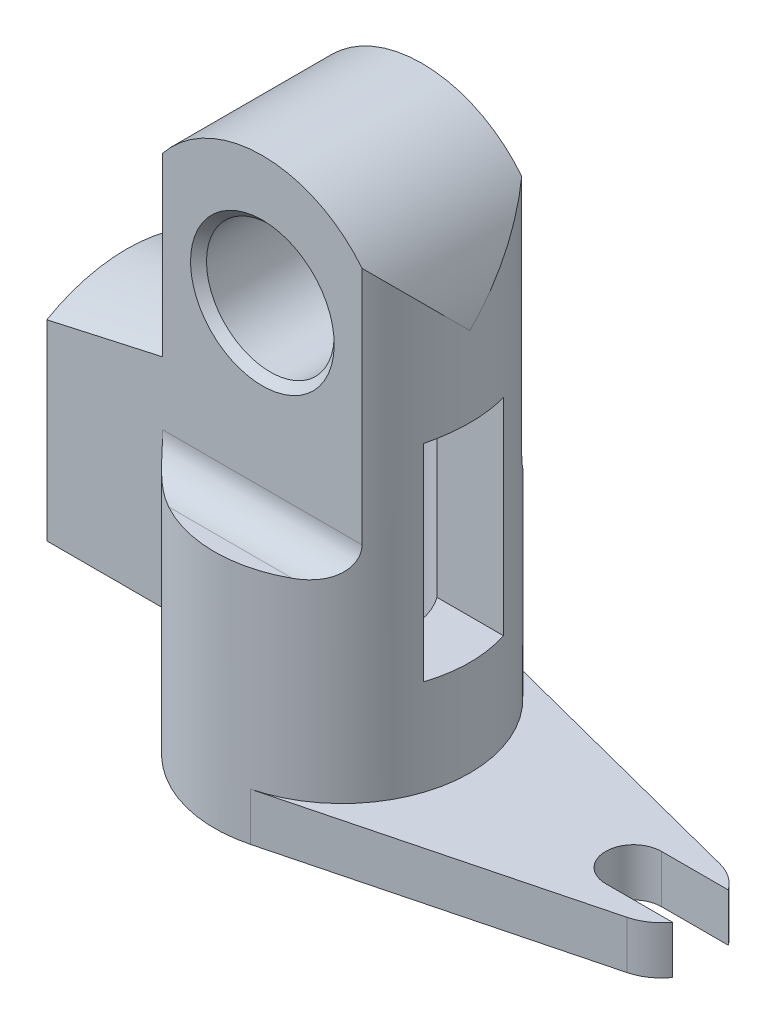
ISO-10303-21;
HEADER;
FILE_DESCRIPTION(('STEP AP214'),'2;1');
FILE_NAME('part.step','',(''),(''),'','','');
FILE_SCHEMA(('AUTOMOTIVE_DESIGN { 1 0 10303 214 1 1 1 1 }'));
ENDSEC;
DATA;
#1=APPLICATION_CONTEXT('core data for automotive mechanical design processes');
#2=APPLICATION_PROTOCOL_DEFINITION('international standard','automotive_design',2000,#1);
#3=PRODUCT_CONTEXT('',#1,'mechanical');
#4=PRODUCT('Part','Part','',(#3));
#5=PRODUCT_RELATED_PRODUCT_CATEGORY('part','',(#4));
#6=PRODUCT_DEFINITION_FORMATION('','',#4);
#7=PRODUCT_DEFINITION_CONTEXT('part definition',#1,'design');
#8=PRODUCT_DEFINITION('design','',#6,#7);
#9=PRODUCT_DEFINITION_SHAPE('','',#8);
#10=(LENGTH_UNIT() NAMED_UNIT(*) SI_UNIT(.MILLI.,.METRE.));
#11=(NAMED_UNIT(*) PLANE_ANGLE_UNIT() SI_UNIT($,.RADIAN.));
#12=(NAMED_UNIT(*) SI_UNIT($,.STERADIAN.) SOLID_ANGLE_UNIT());
#13=UNCERTAINTY_MEASURE_WITH_UNIT(LENGTH_MEASURE(1.E-05),#10,'distance_accuracy_value','');
#14=(GEOMETRIC_REPRESENTATION_CONTEXT(3) GLOBAL_UNCERTAINTY_ASSIGNED_CONTEXT((#13)) GLOBAL_UNIT_ASSIGNED_CONTEXT((#10,
#11,#12)) REPRESENTATION_CONTEXT('',''));
#15=CARTESIAN_POINT('',(0.,0.,0.));
#16=DIRECTION('',(0.,0.,1.));
#17=DIRECTION('',(1.,0.,0.));
#18=AXIS2_PLACEMENT_3D('',#15,#16,#17);
#19=CARTESIAN_POINT('',(-13.5,9.,-2.5));
#20=DIRECTION('',(0.,-1.,0.));
#21=DIRECTION('',(0.,0.,-1.));
#22=AXIS2_PLACEMENT_3D('',#19,#20,#21);
#23=PLANE('',#22);
#24=DIRECTION('',(1.,0.,0.));
#25=VECTOR('',#24,1.);
#26=CARTESIAN_POINT('',(-13.5,9.,-2.5));
#27=LINE('',#26,#25);
#28=CARTESIAN_POINT('',(3.43693177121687,9.,-2.5));
#29=VERTEX_POINT('',#28);
#30=CARTESIAN_POINT('',(7.59934207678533,9.,-2.5));
#31=VERTEX_POINT('',#30);
#32=EDGE_CURVE('E267',#29,#31,#27,.T.);
#33=ORIENTED_EDGE('',*,*,#32,.F.);
#34=CARTESIAN_POINT('',(0.,9.,0.));
#35=DIRECTION('',(0.,-1.,0.));
#36=DIRECTION('',(0.,0.,-1.));
#37=AXIS2_PLACEMENT_3D('',#34,#35,#36);
#38=CIRCLE('',#37,4.24999999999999);
#39=CARTESIAN_POINT('',(3.43693177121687,9.,2.5));
#40=VERTEX_POINT('',#39);
#41=EDGE_CURVE('E251',#29,#40,#38,.T.);
#42=ORIENTED_EDGE('',*,*,#41,.T.);
#43=DIRECTION('',(1.,0.,0.));
#44=VECTOR('',#43,1.);
#45=CARTESIAN_POINT('',(-13.5,9.,2.5));
#46=LINE('',#45,#44);
#47=CARTESIAN_POINT('',(7.59934207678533,9.,2.5));
#48=VERTEX_POINT('',#47);
#49=EDGE_CURVE('E277',#40,#48,#46,.T.);
#50=ORIENTED_EDGE('',*,*,#49,.T.);
#51=CARTESIAN_POINT('',(0.,9.,0.));
#52=DIRECTION('',(0.,-1.,0.));
#53=DIRECTION('',(0.,0.,-1.));
#54=AXIS2_PLACEMENT_3D('',#51,#52,#53);
#55=CIRCLE('',#54,8.);
#56=EDGE_CURVE('E293',#31,#48,#55,.T.);
#57=ORIENTED_EDGE('',*,*,#56,.F.);
#58=EDGE_LOOP('',(#33,#42,#50,#57));
#59=FACE_BOUND('',#58,.T.);
#60=ADVANCED_FACE('F58',(#59),#23,.F.);
#61=CARTESIAN_POINT('',(-13.5,10.6794919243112,0.));
#62=DIRECTION('',(1.,0.,0.));
#63=DIRECTION('',(0.,0.,-1.));
#64=AXIS2_PLACEMENT_3D('',#61,#62,#63);
#65=PLANE('',#64);
#66=CARTESIAN_POINT('',(-13.5,10.6794919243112,0.));
#67=DIRECTION('',(1.,0.,0.));
#68=DIRECTION('',(0.,0.,-1.));
#69=AXIS2_PLACEMENT_3D('',#66,#67,#68);
#70=CIRCLE('',#69,10.);
#71=CARTESIAN_POINT('',(-13.5,19.3397459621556,-5.));
#72=VERTEX_POINT('',#71);
#73=CARTESIAN_POINT('',(-13.5,19.3397459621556,5.));
#74=VERTEX_POINT('',#73);
#75=EDGE_CURVE('E314',#72,#74,#70,.T.);
#76=ORIENTED_EDGE('',*,*,#75,.F.);
#77=DIRECTION('',(0.,1.,0.));
#78=VECTOR('',#77,1.);
#79=CARTESIAN_POINT('',(-13.5,19.3397459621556,-5.));
#80=LINE('',#79,#78);
#81=CARTESIAN_POINT('',(-13.5,7.33974596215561,-5.));
#82=VERTEX_POINT('',#81);
#83=EDGE_CURVE('E680',#82,#72,#80,.T.);
#84=ORIENTED_EDGE('',*,*,#83,.F.);
#85=CARTESIAN_POINT('',(-13.5,16.,0.));
#86=DIRECTION('',(1.,0.,0.));
#87=DIRECTION('',(0.,0.,1.));
#88=AXIS2_PLACEMENT_3D('',#85,#86,#87);
#89=CIRCLE('',#88,10.);
#90=CARTESIAN_POINT('',(-13.5,7.33974596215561,5.));
#91=VERTEX_POINT('',#90);
#92=EDGE_CURVE('E690',#91,#82,#89,.T.);
#93=ORIENTED_EDGE('',*,*,#92,.F.);
#94=DIRECTION('',(0.,-1.,0.));
#95=VECTOR('',#94,1.);
#96=CARTESIAN_POINT('',(-13.5,7.33974596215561,5.));
#97=LINE('',#96,#95);
#98=EDGE_CURVE('E648',#74,#91,#97,.T.);
#99=ORIENTED_EDGE('',*,*,#98,.F.);
#100=EDGE_LOOP('',(#76,#84,#93,#99));
#101=FACE_BOUND('',#100,.T.);
#102=DIRECTION('',(0.,-1.,0.));
#103=VECTOR('',#102,1.);
#104=CARTESIAN_POINT('',(-13.5,18.,-2.5));
#105=LINE('',#104,#103);
#106=CARTESIAN_POINT('',(-13.5,18.,-2.5));
#107=VERTEX_POINT('',#106);
#108=CARTESIAN_POINT('',(-13.5,9.,-2.5));
#109=VERTEX_POINT('',#108);
#110=EDGE_CURVE('E264',#107,#109,#105,.T.);
#111=ORIENTED_EDGE('',*,*,#110,.F.);
#112=DIRECTION('',(0.,0.,1.));
#113=VECTOR('',#112,1.);
#114=CARTESIAN_POINT('',(-13.5,18.,-2.5));
#115=LINE('',#114,#113);
#116=CARTESIAN_POINT('',(-13.5,18.,2.5));
#117=VERTEX_POINT('',#116);
#118=EDGE_CURVE('E282',#107,#117,#115,.T.);
#119=ORIENTED_EDGE('',*,*,#118,.T.);
#120=DIRECTION('',(0.,-1.,0.));
#121=VECTOR('',#120,1.);
#122=CARTESIAN_POINT('',(-13.5,18.,2.5));
#123=LINE('',#122,#121);
#124=CARTESIAN_POINT('',(-13.5,9.,2.5));
#125=VERTEX_POINT('',#124);
#126=EDGE_CURVE('E274',#117,#125,#123,.T.);
#127=ORIENTED_EDGE('',*,*,#126,.T.);
#128=DIRECTION('',(0.,0.,1.));
#129=VECTOR('',#128,1.);
#130=CARTESIAN_POINT('',(-13.5,9.,-2.5));
#131=LINE('',#130,#129);
#132=EDGE_CURVE('E273',#109,#125,#131,.T.);
#133=ORIENTED_EDGE('',*,*,#132,.F.);
#134=EDGE_LOOP('',(#111,#119,#127,#133));
#135=FACE_BOUND('',#134,.T.);
#136=ADVANCED_FACE('F336',(#101,#135),#65,.F.);
#137=CARTESIAN_POINT('',(0.,35.,0.));
#138=DIRECTION('',(0.,-1.,0.));
#139=DIRECTION('',(0.,0.,-1.));
#140=AXIS2_PLACEMENT_3D('',#137,#138,#139);
#141=CYLINDRICAL_SURFACE('',#140,8.);
#142=CARTESIAN_POINT('',(0.,20.5116279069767,0.));
#143=DIRECTION('',(-0.182907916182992,0.983130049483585,0.));
#144=DIRECTION('',(-0.983130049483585,-0.182907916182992,0.));
#145=AXIS2_PLACEMENT_3D('',#142,#143,#144);
#146=ELLIPSE('',#145,8.13727543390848,8.);
#147=CARTESIAN_POINT('',(7.59934207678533,21.9254589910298,2.5));
#148=VERTEX_POINT('',#147);
#149=CARTESIAN_POINT('',(7.59934207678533,21.9254589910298,-2.5));
#150=VERTEX_POINT('',#149);
#151=EDGE_CURVE('E296',#148,#150,#146,.T.);
#152=ORIENTED_EDGE('',*,*,#151,.T.);
#153=DIRECTION('',(0.,-1.,0.));
#154=VECTOR('',#153,1.);
#155=CARTESIAN_POINT('',(7.59934207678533,35.,-2.5));
#156=LINE('',#155,#154);
#157=EDGE_CURVE('E290',#31,#150,#156,.F.);
#158=ORIENTED_EDGE('',*,*,#157,.F.);
#159=ORIENTED_EDGE('',*,*,#56,.T.);
#160=DIRECTION('',(0.,-1.,0.));
#161=VECTOR('',#160,1.);
#162=CARTESIAN_POINT('',(7.59934207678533,35.,2.5));
#163=LINE('',#162,#161);
#164=EDGE_CURVE('E285',#48,#148,#163,.F.);
#165=ORIENTED_EDGE('',*,*,#164,.T.);
#166=EDGE_LOOP('',(#152,#158,#159,#165));
#167=FACE_BOUND('',#166,.T.);
#168=CARTESIAN_POINT('',(0.,3.,0.));
#169=DIRECTION('',(0.,-1.,0.));
#170=DIRECTION('',(0.,0.,-1.));
#171=AXIS2_PLACEMENT_3D('',#168,#169,#170);
#172=CIRCLE('',#171,8.);
#173=CARTESIAN_POINT('',(2.,3.,-7.74596669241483));
#174=VERTEX_POINT('',#173);
#175=CARTESIAN_POINT('',(2.,3.,7.74596669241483));
#176=VERTEX_POINT('',#175);
#177=EDGE_CURVE('E401',#174,#176,#172,.T.);
#178=ORIENTED_EDGE('',*,*,#177,.F.);
#179=DIRECTION('',(0.,-1.,0.));
#180=VECTOR('',#179,1.);
#181=CARTESIAN_POINT('',(2.,3.,-7.74596669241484));
#182=LINE('',#181,#180);
#183=CARTESIAN_POINT('',(2.,0.,-7.74596669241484));
#184=VERTEX_POINT('',#183);
#185=EDGE_CURVE('E531',#174,#184,#182,.T.);
#186=ORIENTED_EDGE('',*,*,#185,.T.);
#187=CARTESIAN_POINT('',(0.,0.,0.));
#188=DIRECTION('',(0.,1.,0.));
#189=DIRECTION('',(0.,0.,1.));
#190=AXIS2_PLACEMENT_3D('',#187,#188,#189);
#191=CIRCLE('',#190,8.);
#192=CARTESIAN_POINT('',(2.,0.,7.74596669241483));
#193=VERTEX_POINT('',#192);
#194=EDGE_CURVE('E517',#184,#193,#191,.T.);
#195=ORIENTED_EDGE('',*,*,#194,.T.);
#196=DIRECTION('',(0.,-1.,0.));
#197=VECTOR('',#196,1.);
#198=CARTESIAN_POINT('',(2.,3.,7.74596669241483));
#199=LINE('',#198,#197);
#200=EDGE_CURVE('E530',#176,#193,#199,.T.);
#201=ORIENTED_EDGE('',*,*,#200,.F.);
#202=EDGE_LOOP('',(#178,#186,#195,#201));
#203=FACE_BOUND('',#202,.T.);
#204=DIRECTION('',(0.,-1.,0.));
#205=VECTOR('',#204,1.);
#206=CARTESIAN_POINT('',(-6.2449979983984,35.,4.99999999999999));
#207=LINE('',#206,#205);
#208=CARTESIAN_POINT('',(-6.24499799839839,7.33974596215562,5.00000000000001));
#209=VERTEX_POINT('',#208);
#210=CARTESIAN_POINT('',(-6.24499799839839,17.,5.));
#211=VERTEX_POINT('',#210);
#212=EDGE_CURVE('E476',#209,#211,#207,.F.);
#213=ORIENTED_EDGE('',*,*,#212,.F.);
#214=CARTESIAN_POINT('',(-6.2449979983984,7.33974596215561,-4.99999999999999));
#215=CARTESIAN_POINT('',(-6.36543668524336,7.25288005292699,-4.84956711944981));
#216=CARTESIAN_POINT('',(-6.48112439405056,7.16826644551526,-4.6939356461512));
#217=CARTESIAN_POINT('',(-6.70222939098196,7.00476474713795,-4.37244086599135));
#218=CARTESIAN_POINT('',(-6.80763658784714,6.92588230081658,-4.20656776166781));
#219=CARTESIAN_POINT('',(-7.0079735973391,6.77463451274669,-3.86368114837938));
#220=CARTESIAN_POINT('',(-7.10281273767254,6.70232642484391,-3.68658905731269));
#221=CARTESIAN_POINT('',(-7.27995557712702,6.56630885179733,-3.3231167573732));
#222=CARTESIAN_POINT('',(-7.36226272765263,6.50259699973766,-3.13673912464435));
#223=CARTESIAN_POINT('',(-7.51375051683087,6.38469073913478,-2.75429062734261));
#224=CARTESIAN_POINT('',(-7.58284400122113,6.3305596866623,-2.55816547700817));
#225=CARTESIAN_POINT('',(-7.70613174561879,6.23357708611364,-2.15853046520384));
#226=CARTESIAN_POINT('',(-7.76032483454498,6.1907264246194,-1.95502002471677));
#227=CARTESIAN_POINT('',(-7.85261429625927,6.11755276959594,-1.54299832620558));
#228=CARTESIAN_POINT('',(-7.89077135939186,6.08718255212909,-1.33450913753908));
#229=CARTESIAN_POINT('',(-7.95049018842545,6.03957998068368,-0.913697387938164));
#230=CARTESIAN_POINT('',(-7.97205483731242,6.02234534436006,-0.701375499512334));
#231=CARTESIAN_POINT('',(-7.99650642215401,6.00279679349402,-0.301494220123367));
#232=CARTESIAN_POINT('',(-8.00137831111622,5.99889731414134,-0.114129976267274));
#233=CARTESIAN_POINT('',(-7.9979531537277,6.00163750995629,0.260392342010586));
#234=CARTESIAN_POINT('',(-7.98965721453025,6.00827629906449,0.447550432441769));
#235=CARTESIAN_POINT('',(-7.96003378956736,6.03194807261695,0.820265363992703));
#236=CARTESIAN_POINT('',(-7.93869912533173,6.04898678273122,1.00582126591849));
#237=CARTESIAN_POINT('',(-7.88335275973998,6.09308467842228,1.37381613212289));
#238=CARTESIAN_POINT('',(-7.84934111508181,6.12014381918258,1.55625511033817));
#239=CARTESIAN_POINT('',(-7.7713027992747,6.18202598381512,1.90720821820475));
#240=CARTESIAN_POINT('',(-7.72790115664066,6.21636253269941,2.07594841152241));
#241=CARTESIAN_POINT('',(-7.6307560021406,6.29291275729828,2.40865305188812));
#242=CARTESIAN_POINT('',(-7.57700868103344,6.33512933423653,2.57261571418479));
#243=CARTESIAN_POINT('',(-7.45977630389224,6.42675998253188,2.89502521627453));
#244=CARTESIAN_POINT('',(-7.39628724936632,6.47617700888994,3.0534697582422));
#245=CARTESIAN_POINT('',(-7.26022762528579,6.5814517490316,3.36420674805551));
#246=CARTESIAN_POINT('',(-7.18765487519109,6.63731100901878,3.51649770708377));
#247=CARTESIAN_POINT('',(-6.98670096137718,6.79089823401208,3.90632265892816));
#248=CARTESIAN_POINT('',(-6.85147684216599,6.89322370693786,4.13858820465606));
#249=CARTESIAN_POINT('',(-6.63426372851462,7.05510517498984,4.47259834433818));
#250=CARTESIAN_POINT('',(-6.55960499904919,7.11036152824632,4.58136087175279));
#251=CARTESIAN_POINT('',(-6.4056961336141,7.22331362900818,4.79419066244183));
#252=CARTESIAN_POINT('',(-6.32644800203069,7.28100830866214,4.89825994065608));
#253=CARTESIAN_POINT('',(-6.24499799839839,7.33974596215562,5.00000000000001));
#254=B_SPLINE_CURVE_WITH_KNOTS('',3,(#214,#215,#216,#217,#218,#219,#220,#221,#222,#223,#224,
#225,#226,#227,#228,#229,#230,#231,#232,#233,#234,#235,#236,#237,#238,#239,#240,#241,#242,#243,
#244,#245,#246,#247,#248,#249,#250,#251,#252,#253),.UNSPECIFIED.,.F.,.F.,(4,2,2,2,2,2,2,2,2,2,2,
2,2,2,2,2,2,2,2,4),(0.,0.63410949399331,1.26883528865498,1.90864448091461,2.5482771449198,
3.19199323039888,3.83575989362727,4.47706770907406,5.11826407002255,5.67992828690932,
6.24154528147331,6.80347175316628,7.36539571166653,7.89759161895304,8.4299838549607,
8.96259519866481,9.49533464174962,10.3561918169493,10.7851358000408,11.21389383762),.UNSPECIFIED.);
#255=CARTESIAN_POINT('',(-6.2449979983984,7.33974596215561,-5.));
#256=VERTEX_POINT('',#255);
#257=EDGE_CURVE('E502',#256,#209,#254,.T.);
#258=ORIENTED_EDGE('',*,*,#257,.F.);
#259=DIRECTION('',(0.,-1.,0.));
#260=VECTOR('',#259,1.);
#261=CARTESIAN_POINT('',(-6.2449979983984,35.,-5.));
#262=LINE('',#261,#260);
#263=CARTESIAN_POINT('',(-6.24499799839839,17.,-5.));
#264=VERTEX_POINT('',#263);
#265=EDGE_CURVE('E356',#264,#256,#262,.T.);
#266=ORIENTED_EDGE('',*,*,#265,.F.);
#267=CARTESIAN_POINT('',(-6.24499799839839,17.,-5.));
#268=CARTESIAN_POINT('',(-6.24500120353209,16.9536158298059,-4.99999069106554));
#269=CARTESIAN_POINT('',(-6.24370616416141,16.9072362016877,-5.00161337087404));
#270=CARTESIAN_POINT('',(-6.23854501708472,16.8148584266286,-5.00805223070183));
#271=CARTESIAN_POINT('',(-6.23467978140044,16.7688601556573,-5.01286732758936));
#272=CARTESIAN_POINT('',(-6.22442782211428,16.6778004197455,-5.02559060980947));
#273=CARTESIAN_POINT('',(-6.21805305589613,16.6327355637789,-5.0334841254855));
#274=CARTESIAN_POINT('',(-6.20283579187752,16.5436603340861,-5.05222458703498));
#275=CARTESIAN_POINT('',(-6.19399319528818,16.4996500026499,-5.0630716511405));
#276=CARTESIAN_POINT('',(-6.16386738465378,16.3697397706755,-5.09977937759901));
#277=CARTESIAN_POINT('',(-6.13896773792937,16.2857982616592,-5.12983003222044));
#278=CARTESIAN_POINT('',(-6.08024329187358,16.1252720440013,-5.19929780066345));
#279=CARTESIAN_POINT('',(-6.04641142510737,16.0486932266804,-5.23872232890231));
#280=CARTESIAN_POINT('',(-5.96894895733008,15.9007807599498,-5.32684062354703));
#281=CARTESIAN_POINT('',(-5.92493762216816,15.829853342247,-5.3758786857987));
#282=CARTESIAN_POINT('',(-5.8292337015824,15.6980184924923,-5.47950967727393));
#283=CARTESIAN_POINT('',(-5.77753798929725,15.6371151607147,-5.53410486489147));
#284=CARTESIAN_POINT('',(-5.64001254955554,15.4972740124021,-5.67486579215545));
#285=CARTESIAN_POINT('',(-5.550040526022,15.4245466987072,-5.76316698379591));
#286=CARTESIAN_POINT('',(-5.35850549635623,15.2994330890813,-5.94168773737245));
#287=CARTESIAN_POINT('',(-5.25691445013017,15.2470974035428,-6.03191149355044));
#288=CARTESIAN_POINT('',(-5.07207770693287,15.1710002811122,-6.18746396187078));
#289=CARTESIAN_POINT('',(-4.99076826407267,15.1433550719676,-6.25326883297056));
#290=CARTESIAN_POINT('',(-4.82408259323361,15.0963887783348,-6.3827393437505));
#291=CARTESIAN_POINT('',(-4.73870396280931,15.0770726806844,-6.44640368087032));
#292=CARTESIAN_POINT('',(-4.56458033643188,15.0455299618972,-6.570850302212));
#293=CARTESIAN_POINT('',(-4.47583374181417,15.0333067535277,-6.63163118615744));
#294=CARTESIAN_POINT('',(-4.29556798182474,15.0148121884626,-6.74979294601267));
#295=CARTESIAN_POINT('',(-4.20404996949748,15.0085383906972,-6.80717520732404));
#296=CARTESIAN_POINT('',(-4.07198289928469,15.0030950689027,-6.88629539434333));
#297=CARTESIAN_POINT('',(-4.03240243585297,15.0019148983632,-6.90954696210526));
#298=CARTESIAN_POINT('',(-3.95293918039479,15.0003686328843,-6.95531218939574));
#299=CARTESIAN_POINT('',(-3.91305745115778,15.0000004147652,-6.97782762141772));
#300=CARTESIAN_POINT('',(-3.87298334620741,15.,-7.));
#301=B_SPLINE_CURVE_WITH_KNOTS('',3,(#267,#268,#269,#270,#271,#272,#273,#274,#275,#276,#277,
#278,#279,#280,#281,#282,#283,#284,#285,#286,#287,#288,#289,#290,#291,#292,#293,#294,#295,#296,
#297,#298,#299,#300),.UNSPECIFIED.,.F.,.F.,(4,2,2,2,2,2,2,2,2,2,2,2,2,2,2,2,4),(0.,
0.139098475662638,0.278149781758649,0.416546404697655,0.554948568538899,0.831264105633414,
1.10779893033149,1.39711980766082,1.68655873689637,2.12073004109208,2.55597216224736,
2.88011889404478,3.20445943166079,3.52895589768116,3.85331916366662,3.99106842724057,
4.12845706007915),.UNSPECIFIED.);
#302=CARTESIAN_POINT('',(-3.87298334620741,15.,-7.));
#303=VERTEX_POINT('',#302);
#304=EDGE_CURVE('E376',#264,#303,#301,.T.);
#305=ORIENTED_EDGE('',*,*,#304,.T.);
#306=CARTESIAN_POINT('',(0.,15.,0.));
#307=DIRECTION('',(0.,1.,0.));
#308=DIRECTION('',(0.,0.,1.));
#309=AXIS2_PLACEMENT_3D('',#306,#307,#308);
#310=CIRCLE('',#309,8.);
#311=CARTESIAN_POINT('',(3.87298334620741,15.,-7.));
#312=VERTEX_POINT('',#311);
#313=EDGE_CURVE('E501',#312,#303,#310,.T.);
#314=ORIENTED_EDGE('',*,*,#313,.F.);
#315=CARTESIAN_POINT('',(3.87298334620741,15.,-7.));
#316=CARTESIAN_POINT('',(3.93257074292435,15.0000025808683,-6.96703150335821));
#317=CARTESIAN_POINT('',(3.99173371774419,15.0008151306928,-6.93330322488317));
#318=CARTESIAN_POINT('',(4.10915825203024,15.0043055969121,-6.86436140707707));
#319=CARTESIAN_POINT('',(4.16741949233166,15.0069841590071,-6.82914735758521));
#320=CARTESIAN_POINT('',(4.34131491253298,15.0182256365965,-6.72098698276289));
#321=CARTESIAN_POINT('',(4.45543517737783,15.0299995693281,-6.64586857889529));
#322=CARTESIAN_POINT('',(4.6802854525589,15.0645605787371,-6.48952683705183));
#323=CARTESIAN_POINT('',(4.79093982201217,15.0875088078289,-6.40822933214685));
#324=CARTESIAN_POINT('',(5.00545050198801,15.1470723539,-6.24209623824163));
#325=CARTESIAN_POINT('',(5.1093238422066,15.1836517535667,-6.15727046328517));
#326=CARTESIAN_POINT('',(5.25536740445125,15.2492939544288,-6.03198817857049));
#327=CARTESIAN_POINT('',(5.30087739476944,15.271946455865,-5.99201728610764));
#328=CARTESIAN_POINT('',(5.38983139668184,15.321089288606,-5.91213096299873));
#329=CARTESIAN_POINT('',(5.43327528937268,15.3475798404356,-5.87221553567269));
#330=CARTESIAN_POINT('',(5.55982062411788,15.432996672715,-5.75340679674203));
#331=CARTESIAN_POINT('',(5.6395188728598,15.4980342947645,-5.67511976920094));
#332=CARTESIAN_POINT('',(5.78833073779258,15.6469593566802,-5.52328436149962));
#333=CARTESIAN_POINT('',(5.85728999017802,15.7310853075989,-5.4498125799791));
#334=CARTESIAN_POINT('',(5.94961458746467,15.8707605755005,-5.3482905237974));
#335=CARTESIAN_POINT('',(5.97853929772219,15.9195720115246,-5.31589477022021));
#336=CARTESIAN_POINT('',(6.03237697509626,16.0214683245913,-5.25471970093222));
#337=CARTESIAN_POINT('',(6.05729178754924,16.0745512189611,-5.22593872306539));
#338=CARTESIAN_POINT('',(6.11235689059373,16.2077770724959,-5.16154762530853));
#339=CARTESIAN_POINT('',(6.14031640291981,16.2899273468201,-5.12814037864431));
#340=CARTESIAN_POINT('',(6.18667518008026,16.4602860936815,-5.07211836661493));
#341=CARTESIAN_POINT('',(6.20508922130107,16.5484849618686,-5.0494869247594));
#342=CARTESIAN_POINT('',(6.22728241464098,16.697668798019,-5.02206642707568));
#343=CARTESIAN_POINT('',(6.2339142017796,16.7576238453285,-5.01382085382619));
#344=CARTESIAN_POINT('',(6.24277573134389,16.8783738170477,-5.0027757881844));
#345=CARTESIAN_POINT('',(6.24500399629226,16.9391690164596,-4.99997812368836));
#346=CARTESIAN_POINT('',(6.2449979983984,17.,-5.));
#347=B_SPLINE_CURVE_WITH_KNOTS('',3,(#315,#316,#317,#318,#319,#320,#321,#322,#323,#324,#325,
#326,#327,#328,#329,#330,#331,#332,#333,#334,#335,#336,#337,#338,#339,#340,#341,#342,#343,#344,
#345,#346),.UNSPECIFIED.,.F.,.F.,(4,2,2,2,2,2,2,2,2,2,2,2,2,2,2,4),(0.,0.204278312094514,
0.408627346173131,0.819464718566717,1.23641087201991,1.65226607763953,1.84614256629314,
2.04003019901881,2.42622065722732,2.81753195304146,3.01322486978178,3.20882747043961,
3.48651714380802,3.7637756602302,3.94603638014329,4.12835824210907),.UNSPECIFIED.);
#348=CARTESIAN_POINT('',(6.24499799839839,17.,-5.));
#349=VERTEX_POINT('',#348);
#350=EDGE_CURVE('E385',#312,#349,#347,.T.);
#351=ORIENTED_EDGE('',*,*,#350,.T.);
#352=DIRECTION('',(0.,-1.,0.));
#353=VECTOR('',#352,1.);
#354=CARTESIAN_POINT('',(6.24499799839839,35.,-5.));
#355=LINE('',#354,#353);
#356=CARTESIAN_POINT('',(6.24499799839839,32.,-5.00000000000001));
#357=VERTEX_POINT('',#356);
#358=EDGE_CURVE('E525',#357,#349,#355,.T.);
#359=ORIENTED_EDGE('',*,*,#358,.F.);
#360=CARTESIAN_POINT('',(0.,27.,0.));
#361=DIRECTION('',(0.,-0.707106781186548,-0.707106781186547));
#362=DIRECTION('',(0.,-0.707106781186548,0.707106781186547));
#363=AXIS2_PLACEMENT_3D('',#360,#361,#362);
#364=ELLIPSE('',#363,11.3137084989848,8.);
#365=CARTESIAN_POINT('',(8.,27.,0.));
#366=VERTEX_POINT('',#365);
#367=EDGE_CURVE('E485',#357,#366,#364,.T.);
#368=ORIENTED_EDGE('',*,*,#367,.T.);
#369=CARTESIAN_POINT('',(0.,27.,0.));
#370=DIRECTION('',(0.,-0.707106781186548,0.707106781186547));
#371=DIRECTION('',(0.,-0.707106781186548,-0.707106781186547));
#372=AXIS2_PLACEMENT_3D('',#369,#370,#371);
#373=ELLIPSE('',#372,11.3137084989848,8.);
#374=CARTESIAN_POINT('',(6.2449979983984,32.,5.00000000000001));
#375=VERTEX_POINT('',#374);
#376=EDGE_CURVE('E484',#366,#375,#373,.T.);
#377=ORIENTED_EDGE('',*,*,#376,.T.);
#378=DIRECTION('',(0.,-1.,0.));
#379=VECTOR('',#378,1.);
#380=CARTESIAN_POINT('',(6.24499799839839,35.,5.));
#381=LINE('',#380,#379);
#382=CARTESIAN_POINT('',(6.24499799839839,17.,5.));
#383=VERTEX_POINT('',#382);
#384=EDGE_CURVE('E473',#375,#383,#381,.T.);
#385=ORIENTED_EDGE('',*,*,#384,.T.);
#386=CARTESIAN_POINT('',(6.24499799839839,17.,5.));
#387=CARTESIAN_POINT('',(6.24500120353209,16.9536158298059,4.99999069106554));
#388=CARTESIAN_POINT('',(6.24370616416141,16.9072362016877,5.00161337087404));
#389=CARTESIAN_POINT('',(6.23854501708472,16.8148584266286,5.00805223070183));
#390=CARTESIAN_POINT('',(6.23467978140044,16.7688601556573,5.01286732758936));
#391=CARTESIAN_POINT('',(6.22442782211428,16.6778004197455,5.02559060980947));
#392=CARTESIAN_POINT('',(6.21805305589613,16.6327355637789,5.0334841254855));
#393=CARTESIAN_POINT('',(6.20283579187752,16.5436603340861,5.05222458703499));
#394=CARTESIAN_POINT('',(6.19399319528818,16.4996500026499,5.0630716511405));
#395=CARTESIAN_POINT('',(6.16386738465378,16.3697397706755,5.09977937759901));
#396=CARTESIAN_POINT('',(6.13896773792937,16.2857982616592,5.12983003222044));
#397=CARTESIAN_POINT('',(6.08024329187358,16.1252720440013,5.19929780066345));
#398=CARTESIAN_POINT('',(6.04641142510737,16.0486932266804,5.23872232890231));
#399=CARTESIAN_POINT('',(5.96894895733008,15.9007807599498,5.32684062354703));
#400=CARTESIAN_POINT('',(5.92493762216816,15.829853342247,5.3758786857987));
#401=CARTESIAN_POINT('',(5.8292337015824,15.6980184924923,5.47950967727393));
#402=CARTESIAN_POINT('',(5.77753798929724,15.6371151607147,5.53410486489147));
#403=CARTESIAN_POINT('',(5.64001254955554,15.4972740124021,5.67486579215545));
#404=CARTESIAN_POINT('',(5.550040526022,15.4245466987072,5.76316698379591));
#405=CARTESIAN_POINT('',(5.35850549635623,15.2994330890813,5.94168773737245));
#406=CARTESIAN_POINT('',(5.25691445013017,15.2470974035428,6.03191149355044));
#407=CARTESIAN_POINT('',(5.07207770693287,15.1710002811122,6.18746396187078));
#408=CARTESIAN_POINT('',(4.99076826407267,15.1433550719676,6.25326883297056));
#409=CARTESIAN_POINT('',(4.82408259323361,15.0963887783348,6.3827393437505));
#410=CARTESIAN_POINT('',(4.73870396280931,15.0770726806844,6.44640368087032));
#411=CARTESIAN_POINT('',(4.56458033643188,15.0455299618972,6.570850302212));
#412=CARTESIAN_POINT('',(4.47583374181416,15.0333067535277,6.63163118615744));
#413=CARTESIAN_POINT('',(4.29556798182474,15.0148121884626,6.74979294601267));
#414=CARTESIAN_POINT('',(4.20404996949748,15.0085383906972,6.80717520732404));
#415=CARTESIAN_POINT('',(4.07198289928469,15.0030950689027,6.88629539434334));
#416=CARTESIAN_POINT('',(4.03240243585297,15.0019148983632,6.90954696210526));
#417=CARTESIAN_POINT('',(3.95293918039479,15.0003686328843,6.95531218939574));
#418=CARTESIAN_POINT('',(3.91305745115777,15.0000004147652,6.97782762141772));
#419=CARTESIAN_POINT('',(3.87298334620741,15.,7.));
#420=B_SPLINE_CURVE_WITH_KNOTS('',3,(#386,#387,#388,#389,#390,#391,#392,#393,#394,#395,#396,
#397,#398,#399,#400,#401,#402,#403,#404,#405,#406,#407,#408,#409,#410,#411,#412,#413,#414,#415,
#416,#417,#418,#419),.UNSPECIFIED.,.F.,.F.,(4,2,2,2,2,2,2,2,2,2,2,2,2,2,2,2,4),(0.,
0.139098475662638,0.278149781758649,0.416546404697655,0.554948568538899,0.831264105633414,
1.10779893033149,1.39711980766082,1.68655873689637,2.12073004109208,2.55597216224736,
2.88011889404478,3.20445943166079,3.52895589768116,3.85331916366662,3.99106842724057,
4.12845706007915),.UNSPECIFIED.);
#421=CARTESIAN_POINT('',(3.87298334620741,15.,7.));
#422=VERTEX_POINT('',#421);
#423=EDGE_CURVE('E396',#383,#422,#420,.T.);
#424=ORIENTED_EDGE('',*,*,#423,.T.);
#425=CARTESIAN_POINT('',(0.,15.,0.));
#426=DIRECTION('',(0.,-1.,0.));
#427=DIRECTION('',(0.,0.,-1.));
#428=AXIS2_PLACEMENT_3D('',#425,#426,#427);
#429=CIRCLE('',#428,8.);
#430=CARTESIAN_POINT('',(-3.87298334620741,15.,7.));
#431=VERTEX_POINT('',#430);
#432=EDGE_CURVE('E513',#422,#431,#429,.T.);
#433=ORIENTED_EDGE('',*,*,#432,.T.);
#434=CARTESIAN_POINT('',(-3.87298334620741,15.,7.));
#435=CARTESIAN_POINT('',(-3.93257074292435,15.0000025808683,6.96703150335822));
#436=CARTESIAN_POINT('',(-3.99173371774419,15.0008151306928,6.93330322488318));
#437=CARTESIAN_POINT('',(-4.10915825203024,15.0043055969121,6.86436140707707));
#438=CARTESIAN_POINT('',(-4.16741949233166,15.0069841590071,6.82914735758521));
#439=CARTESIAN_POINT('',(-4.34131491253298,15.0182256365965,6.72098698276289));
#440=CARTESIAN_POINT('',(-4.45543517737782,15.0299995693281,6.64586857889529));
#441=CARTESIAN_POINT('',(-4.6802854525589,15.0645605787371,6.48952683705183));
#442=CARTESIAN_POINT('',(-4.79093982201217,15.0875088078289,6.40822933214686));
#443=CARTESIAN_POINT('',(-5.00545050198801,15.1470723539,6.24209623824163));
#444=CARTESIAN_POINT('',(-5.10932384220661,15.1836517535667,6.15727046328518));
#445=CARTESIAN_POINT('',(-5.25536740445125,15.2492939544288,6.03198817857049));
#446=CARTESIAN_POINT('',(-5.30087739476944,15.271946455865,5.99201728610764));
#447=CARTESIAN_POINT('',(-5.38983139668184,15.321089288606,5.91213096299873));
#448=CARTESIAN_POINT('',(-5.43327528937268,15.3475798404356,5.87221553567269));
#449=CARTESIAN_POINT('',(-5.55982062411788,15.432996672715,5.75340679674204));
#450=CARTESIAN_POINT('',(-5.6395188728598,15.4980342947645,5.67511976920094));
#451=CARTESIAN_POINT('',(-5.78833073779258,15.6469593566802,5.52328436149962));
#452=CARTESIAN_POINT('',(-5.85728999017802,15.7310853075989,5.4498125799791));
#453=CARTESIAN_POINT('',(-5.94961458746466,15.8707605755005,5.3482905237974));
#454=CARTESIAN_POINT('',(-5.97853929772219,15.9195720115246,5.31589477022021));
#455=CARTESIAN_POINT('',(-6.03237697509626,16.0214683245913,5.25471970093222));
#456=CARTESIAN_POINT('',(-6.05729178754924,16.0745512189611,5.22593872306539));
#457=CARTESIAN_POINT('',(-6.11235689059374,16.2077770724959,5.16154762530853));
#458=CARTESIAN_POINT('',(-6.14031640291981,16.2899273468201,5.12814037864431));
#459=CARTESIAN_POINT('',(-6.18667518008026,16.4602860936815,5.07211836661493));
#460=CARTESIAN_POINT('',(-6.20508922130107,16.5484849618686,5.0494869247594));
#461=CARTESIAN_POINT('',(-6.22728241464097,16.697668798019,5.02206642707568));
#462=CARTESIAN_POINT('',(-6.2339142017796,16.7576238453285,5.01382085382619));
#463=CARTESIAN_POINT('',(-6.24277573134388,16.8783738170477,5.0027757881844));
#464=CARTESIAN_POINT('',(-6.24500399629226,16.9391690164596,4.99997812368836));
#465=CARTESIAN_POINT('',(-6.2449979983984,17.,5.));
#466=B_SPLINE_CURVE_WITH_KNOTS('',3,(#434,#435,#436,#437,#438,#439,#440,#441,#442,#443,#444,
#445,#446,#447,#448,#449,#450,#451,#452,#453,#454,#455,#456,#457,#458,#459,#460,#461,#462,#463,
#464,#465),.UNSPECIFIED.,.F.,.F.,(4,2,2,2,2,2,2,2,2,2,2,2,2,2,2,4),(0.,0.204278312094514,
0.408627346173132,0.819464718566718,1.23641087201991,1.65226607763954,1.84614256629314,
2.04003019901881,2.42622065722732,2.81753195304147,3.01322486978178,3.20882747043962,
3.48651714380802,3.7637756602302,3.94603638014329,4.12835824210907),.UNSPECIFIED.);
#467=EDGE_CURVE('E391',#431,#211,#466,.T.);
#468=ORIENTED_EDGE('',*,*,#467,.T.);
#469=EDGE_LOOP('',(#213,#258,#266,#305,#314,#351,#359,#368,#377,#385,#424,#433,#468));
#470=FACE_BOUND('',#469,.T.);
#471=ADVANCED_FACE('F367',(#167,#203,#470),#141,.T.);
#472=CARTESIAN_POINT('',(0.,0.,0.));
#473=DIRECTION('',(0.,1.,0.));
#474=DIRECTION('',(0.,0.,1.));
#475=AXIS2_PLACEMENT_3D('',#472,#473,#474);
#476=PLANE('',#475);
#477=CARTESIAN_POINT('',(0.,0.,0.));
#478=DIRECTION('',(0.,-1.,0.));
#479=DIRECTION('',(0.,0.,-1.));
#480=AXIS2_PLACEMENT_3D('',#477,#478,#479);
#481=CIRCLE('',#480,4.24999999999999);
#482=CARTESIAN_POINT('',(0.,0.,-4.24999999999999));
#483=VERTEX_POINT('',#482);
#484=EDGE_CURVE('E761',#483,#483,#481,.T.);
#485=ORIENTED_EDGE('',*,*,#484,.F.);
#486=EDGE_LOOP('',(#485));
#487=FACE_BOUND('',#486,.T.);
#488=DIRECTION('',(-1.,0.,0.));
#489=VECTOR('',#488,1.);
#490=CARTESIAN_POINT('',(0.,0.,1.75));
#491=LINE('',#490,#489);
#492=CARTESIAN_POINT('',(22.4366985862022,0.,1.75));
#493=VERTEX_POINT('',#492);
#494=CARTESIAN_POINT('',(18.25,0.,1.75));
#495=VERTEX_POINT('',#494);
#496=EDGE_CURVE('E563',#493,#495,#491,.T.);
#497=ORIENTED_EDGE('',*,*,#496,.F.);
#498=CARTESIAN_POINT('',(20.,0.,0.));
#499=DIRECTION('',(0.,-1.,0.));
#500=DIRECTION('',(0.,0.,-1.));
#501=AXIS2_PLACEMENT_3D('',#498,#499,#500);
#502=CIRCLE('',#501,3.);
#503=CARTESIAN_POINT('',(20.75,0.,2.90473750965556));
#504=VERTEX_POINT('',#503);
#505=EDGE_CURVE('E549',#493,#504,#502,.T.);
#506=ORIENTED_EDGE('',*,*,#505,.T.);
#507=DIRECTION('',(-0.968245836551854,0.,0.25));
#508=VECTOR('',#507,1.);
#509=CARTESIAN_POINT('',(2.,0.,7.74596669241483));
#510=LINE('',#509,#508);
#511=EDGE_CURVE('E542',#504,#193,#510,.T.);
#512=ORIENTED_EDGE('',*,*,#511,.T.);
#513=ORIENTED_EDGE('',*,*,#194,.F.);
#514=DIRECTION('',(0.968245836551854,0.,0.25));
#515=VECTOR('',#514,1.);
#516=CARTESIAN_POINT('',(2.,0.,-7.74596669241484));
#517=LINE('',#516,#515);
#518=CARTESIAN_POINT('',(20.75,0.,-2.90473750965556));
#519=VERTEX_POINT('',#518);
#520=EDGE_CURVE('E550',#184,#519,#517,.T.);
#521=ORIENTED_EDGE('',*,*,#520,.T.);
#522=CARTESIAN_POINT('',(22.4366985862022,0.,-1.75));
#523=VERTEX_POINT('',#522);
#524=EDGE_CURVE('E546',#519,#523,#502,.T.);
#525=ORIENTED_EDGE('',*,*,#524,.T.);
#526=DIRECTION('',(1.,0.,0.));
#527=VECTOR('',#526,1.);
#528=CARTESIAN_POINT('',(0.,0.,-1.75));
#529=LINE('',#528,#527);
#530=CARTESIAN_POINT('',(18.25,0.,-1.75));
#531=VERTEX_POINT('',#530);
#532=EDGE_CURVE('E567',#531,#523,#529,.T.);
#533=ORIENTED_EDGE('',*,*,#532,.F.);
#534=CARTESIAN_POINT('',(18.25,0.,0.));
#535=DIRECTION('',(0.,1.,0.));
#536=DIRECTION('',(0.,0.,1.));
#537=AXIS2_PLACEMENT_3D('',#534,#535,#536);
#538=CIRCLE('',#537,1.75);
#539=EDGE_CURVE('E553',#495,#531,#538,.F.);
#540=ORIENTED_EDGE('',*,*,#539,.F.);
#541=EDGE_LOOP('',(#497,#506,#512,#513,#521,#525,#533,#540));
#542=FACE_BOUND('',#541,.T.);
#543=ADVANCED_FACE('F368',(#487,#542),#476,.F.);
#544=CARTESIAN_POINT('',(0.,3.,0.));
#545=DIRECTION('',(0.,-1.,0.));
#546=DIRECTION('',(0.,0.,-1.));
#547=AXIS2_PLACEMENT_3D('',#544,#545,#546);
#548=PLANE('',#547);
#549=DIRECTION('',(1.,0.,0.));
#550=VECTOR('',#549,1.);
#551=CARTESIAN_POINT('',(0.,3.,1.75));
#552=LINE('',#551,#550);
#553=CARTESIAN_POINT('',(18.25,3.,1.75));
#554=VERTEX_POINT('',#553);
#555=CARTESIAN_POINT('',(22.4366985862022,3.,1.75));
#556=VERTEX_POINT('',#555);
#557=EDGE_CURVE('E565',#554,#556,#552,.T.);
#558=ORIENTED_EDGE('',*,*,#557,.F.);
#559=CARTESIAN_POINT('',(18.25,3.,0.));
#560=DIRECTION('',(0.,-1.,0.));
#561=DIRECTION('',(0.,0.,-1.));
#562=AXIS2_PLACEMENT_3D('',#559,#560,#561);
#563=CIRCLE('',#562,1.75);
#564=CARTESIAN_POINT('',(18.25,3.,-1.75));
#565=VERTEX_POINT('',#564);
#566=EDGE_CURVE('E499',#565,#554,#563,.F.);
#567=ORIENTED_EDGE('',*,*,#566,.F.);
#568=DIRECTION('',(-1.,0.,0.));
#569=VECTOR('',#568,1.);
#570=CARTESIAN_POINT('',(0.,3.,-1.75));
#571=LINE('',#570,#569);
#572=CARTESIAN_POINT('',(22.4366985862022,3.,-1.75));
#573=VERTEX_POINT('',#572);
#574=EDGE_CURVE('E569',#573,#565,#571,.T.);
#575=ORIENTED_EDGE('',*,*,#574,.F.);
#576=CARTESIAN_POINT('',(20.,3.,0.));
#577=DIRECTION('',(0.,-1.,0.));
#578=DIRECTION('',(0.,0.,-1.));
#579=AXIS2_PLACEMENT_3D('',#576,#577,#578);
#580=CIRCLE('',#579,3.);
#581=CARTESIAN_POINT('',(20.75,3.,-2.90473750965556));
#582=VERTEX_POINT('',#581);
#583=EDGE_CURVE('E556',#582,#573,#580,.T.);
#584=ORIENTED_EDGE('',*,*,#583,.F.);
#585=DIRECTION('',(0.968245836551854,0.,0.25));
#586=VECTOR('',#585,1.);
#587=CARTESIAN_POINT('',(2.,3.,-7.74596669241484));
#588=LINE('',#587,#586);
#589=EDGE_CURVE('E545',#174,#582,#588,.T.);
#590=ORIENTED_EDGE('',*,*,#589,.F.);
#591=ORIENTED_EDGE('',*,*,#177,.T.);
#592=DIRECTION('',(-0.968245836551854,0.,0.25));
#593=VECTOR('',#592,1.);
#594=CARTESIAN_POINT('',(2.,3.,7.74596669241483));
#595=LINE('',#594,#593);
#596=CARTESIAN_POINT('',(20.75,3.,2.90473750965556));
#597=VERTEX_POINT('',#596);
#598=EDGE_CURVE('E535',#597,#176,#595,.T.);
#599=ORIENTED_EDGE('',*,*,#598,.F.);
#600=EDGE_CURVE('E559',#556,#597,#580,.T.);
#601=ORIENTED_EDGE('',*,*,#600,.F.);
#602=EDGE_LOOP('',(#558,#567,#575,#584,#590,#591,#599,#601));
#603=FACE_BOUND('',#602,.T.);
#604=ADVANCED_FACE('F585',(#603),#548,.F.);
#605=CARTESIAN_POINT('',(20.,3.,0.));
#606=DIRECTION('',(0.,-1.,0.));
#607=DIRECTION('',(0.,0.,-1.));
#608=AXIS2_PLACEMENT_3D('',#605,#606,#607);
#609=CYLINDRICAL_SURFACE('',#608,3.);
#610=ORIENTED_EDGE('',*,*,#505,.F.);
#611=DIRECTION('',(0.,-1.,0.));
#612=VECTOR('',#611,1.);
#613=CARTESIAN_POINT('',(22.4366985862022,3.,1.75));
#614=LINE('',#613,#612);
#615=EDGE_CURVE('E588',#493,#556,#614,.F.);
#616=ORIENTED_EDGE('',*,*,#615,.T.);
#617=ORIENTED_EDGE('',*,*,#600,.T.);
#618=DIRECTION('',(0.,-1.,0.));
#619=VECTOR('',#618,1.);
#620=CARTESIAN_POINT('',(20.75,3.,2.90473750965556));
#621=LINE('',#620,#619);
#622=EDGE_CURVE('E537',#597,#504,#621,.T.);
#623=ORIENTED_EDGE('',*,*,#622,.T.);
#624=EDGE_LOOP('',(#610,#616,#617,#623));
#625=FACE_BOUND('',#624,.T.);
#626=ADVANCED_FACE('F605',(#625),#609,.T.);
#627=ORIENTED_EDGE('',*,*,#583,.T.);
#628=DIRECTION('',(0.,-1.,0.));
#629=VECTOR('',#628,1.);
#630=CARTESIAN_POINT('',(22.4366985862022,3.,-1.75));
#631=LINE('',#630,#629);
#632=EDGE_CURVE('E591',#573,#523,#631,.T.);
#633=ORIENTED_EDGE('',*,*,#632,.T.);
#634=ORIENTED_EDGE('',*,*,#524,.F.);
#635=DIRECTION('',(0.,-1.,0.));
#636=VECTOR('',#635,1.);
#637=CARTESIAN_POINT('',(20.75,3.,-2.90473750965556));
#638=LINE('',#637,#636);
#639=EDGE_CURVE('E534',#582,#519,#638,.T.);
#640=ORIENTED_EDGE('',*,*,#639,.F.);
#641=EDGE_LOOP('',(#627,#633,#634,#640));
#642=FACE_BOUND('',#641,.T.);
#643=ADVANCED_FACE('F365',(#642),#609,.T.);
#644=DIRECTION('',(0.,-1.,0.));
#645=VECTOR('',#644,1.);
#646=CARTESIAN_POINT('',(-6.24499799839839,35.,-5.));
#647=LINE('',#646,#645);
#648=CARTESIAN_POINT('',(-6.2449979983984,20.9519686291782,-5.));
#649=VERTEX_POINT('',#648);
#650=CARTESIAN_POINT('',(-6.24499799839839,32.,-5.00000000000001));
#651=VERTEX_POINT('',#650);
#652=EDGE_CURVE('E528',#649,#651,#647,.F.);
#653=ORIENTED_EDGE('',*,*,#652,.F.);
#654=CARTESIAN_POINT('',(-6.2449979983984,20.9519686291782,-5.));
#655=CARTESIAN_POINT('',(-6.33129479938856,20.9950221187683,-4.89221656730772));
#656=CARTESIAN_POINT('',(-6.41494993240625,21.0373323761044,-4.78201068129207));
#657=CARTESIAN_POINT('',(-6.57678612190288,21.1201529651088,-4.55687545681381));
#658=CARTESIAN_POINT('',(-6.65496337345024,21.1606620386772,-4.44194292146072));
#659=CARTESIAN_POINT('',(-6.80554980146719,21.2395150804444,-4.20759955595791));
#660=CARTESIAN_POINT('',(-6.87795773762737,21.2778585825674,-4.088187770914));
#661=CARTESIAN_POINT('',(-7.01701695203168,21.3521819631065,-3.84463510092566));
#662=CARTESIAN_POINT('',(-7.08364301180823,21.3881513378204,-3.72047659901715));
#663=CARTESIAN_POINT('',(-7.21052103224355,21.4571918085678,-3.46818630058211));
#664=CARTESIAN_POINT('',(-7.2707742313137,21.490263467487,-3.34005528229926));
#665=CARTESIAN_POINT('',(-7.38464555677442,21.5531704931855,-3.08012157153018));
#666=CARTESIAN_POINT('',(-7.43826414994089,21.583006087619,-2.94831913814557));
#667=CARTESIAN_POINT('',(-7.56401359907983,21.6532503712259,-2.61377133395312));
#668=CARTESIAN_POINT('',(-7.63178257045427,21.6913696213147,-2.40887640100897));
#669=CARTESIAN_POINT('',(-7.75081832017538,21.758606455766,-1.99289481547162));
#670=CARTESIAN_POINT('',(-7.80208360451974,21.7877232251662,-1.78180760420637));
#671=CARTESIAN_POINT('',(-7.88729951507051,21.8363812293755,-1.35558902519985));
#672=CARTESIAN_POINT('',(-7.9212903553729,21.8559446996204,-1.14046827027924));
#673=CARTESIAN_POINT('',(-7.97163115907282,21.8850856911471,-0.70751596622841));
#674=CARTESIAN_POINT('',(-7.98798340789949,21.8946645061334,-0.48968477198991));
#675=CARTESIAN_POINT('',(-8.00221639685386,21.9029960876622,-0.0705005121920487));
#676=CARTESIAN_POINT('',(-8.00145700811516,21.9025458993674,0.130791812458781));
#677=CARTESIAN_POINT('',(-7.98478726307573,21.8927919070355,0.53252869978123));
#678=CARTESIAN_POINT('',(-7.96887722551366,21.8834882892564,0.732973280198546));
#679=CARTESIAN_POINT('',(-7.92210019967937,21.8564171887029,1.13165442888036));
#680=CARTESIAN_POINT('',(-7.89122357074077,21.8386442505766,1.32988948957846));
#681=CARTESIAN_POINT('',(-7.81489625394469,21.7950222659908,1.72261768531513));
#682=CARTESIAN_POINT('',(-7.7694459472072,21.7691734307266,1.91711091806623));
#683=CARTESIAN_POINT('',(-7.66561309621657,21.710446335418,2.2970283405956));
#684=CARTESIAN_POINT('',(-7.60752253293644,21.6777272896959,2.48255723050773));
#685=CARTESIAN_POINT('',(-7.47850165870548,21.605426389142,2.84772175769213));
#686=CARTESIAN_POINT('',(-7.40757052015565,21.5658440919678,3.02735701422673));
#687=CARTESIAN_POINT('',(-7.25356010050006,21.4807448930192,3.37976784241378));
#688=CARTESIAN_POINT('',(-7.17048633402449,21.4352306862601,3.55254648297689));
#689=CARTESIAN_POINT('',(-6.99285412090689,21.3391278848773,3.89055684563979));
#690=CARTESIAN_POINT('',(-6.89829878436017,21.2885406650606,4.05579059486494));
#691=CARTESIAN_POINT('',(-6.7135307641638,21.1911565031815,4.35366380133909));
#692=CARTESIAN_POINT('',(-6.62483715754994,21.1449496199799,4.48744396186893));
#693=CARTESIAN_POINT('',(-6.44025171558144,21.050143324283,4.74854287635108));
#694=CARTESIAN_POINT('',(-6.34437747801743,21.0015498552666,4.87587622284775));
#695=CARTESIAN_POINT('',(-6.2449979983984,20.9519686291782,5.));
#696=B_SPLINE_CURVE_WITH_KNOTS('',3,(#654,#655,#656,#657,#658,#659,#660,#661,#662,#663,#664,
#665,#666,#667,#668,#669,#670,#671,#672,#673,#674,#675,#676,#677,#678,#679,#680,#681,#682,#683,
#684,#685,#686,#687,#688,#689,#690,#691,#692,#693,#694,#695),.UNSPECIFIED.,.F.,.F.,(4,2,2,2,2,2,
2,2,2,2,2,2,2,2,2,2,2,2,2,2,4),(0.,0.433857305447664,0.86801304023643,1.30226186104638,
1.73831836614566,2.17428997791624,2.61023089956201,3.26676767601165,3.92336386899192,
4.57842445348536,5.23340015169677,5.8365224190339,6.43963199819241,7.04313058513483,
7.64661339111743,8.237408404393,8.82824150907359,9.41880711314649,10.0092131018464,
10.5100092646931,11.0096159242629),.UNSPECIFIED.);
#697=CARTESIAN_POINT('',(-6.2449979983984,20.9519686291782,5.));
#698=VERTEX_POINT('',#697);
#699=EDGE_CURVE('E348',#649,#698,#696,.T.);
#700=ORIENTED_EDGE('',*,*,#699,.T.);
#701=DIRECTION('',(0.,-1.,0.));
#702=VECTOR('',#701,1.);
#703=CARTESIAN_POINT('',(-6.24499799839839,35.,5.));
#704=LINE('',#703,#702);
#705=CARTESIAN_POINT('',(-6.2449979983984,32.,5.00000000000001));
#706=VERTEX_POINT('',#705);
#707=EDGE_CURVE('E486',#698,#706,#704,.F.);
#708=ORIENTED_EDGE('',*,*,#707,.T.);
#709=CARTESIAN_POINT('',(-8.,27.,0.));
#710=VERTEX_POINT('',#709);
#711=EDGE_CURVE('E522',#706,#710,#373,.T.);
#712=ORIENTED_EDGE('',*,*,#711,.T.);
#713=EDGE_CURVE('E519',#710,#651,#364,.T.);
#714=ORIENTED_EDGE('',*,*,#713,.T.);
#715=EDGE_LOOP('',(#653,#700,#708,#712,#714));
#716=FACE_BOUND('',#715,.T.);
#717=ADVANCED_FACE('F359',(#716),#141,.T.);
#718=CARTESIAN_POINT('',(0.,27.,62.0966649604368));
#719=DIRECTION('',(0.,0.,-1.));
#720=DIRECTION('',(-1.,0.,0.));
#721=AXIS2_PLACEMENT_3D('',#718,#719,#720);
#722=CYLINDRICAL_SURFACE('',#721,8.);
#723=ORIENTED_EDGE('',*,*,#367,.F.);
#724=CARTESIAN_POINT('',(0.,27.,-5.));
#725=DIRECTION('',(0.,0.,-1.));
#726=DIRECTION('',(0.,1.,0.));
#727=AXIS2_PLACEMENT_3D('',#724,#725,#726);
#728=CIRCLE('',#727,8.);
#729=EDGE_CURVE('E511',#651,#357,#728,.T.);
#730=ORIENTED_EDGE('',*,*,#729,.F.);
#731=ORIENTED_EDGE('',*,*,#713,.F.);
#732=ORIENTED_EDGE('',*,*,#711,.F.);
#733=CARTESIAN_POINT('',(0.,27.,5.));
#734=DIRECTION('',(0.,0.,-1.));
#735=DIRECTION('',(0.,1.,0.));
#736=AXIS2_PLACEMENT_3D('',#733,#734,#735);
#737=CIRCLE('',#736,8.);
#738=EDGE_CURVE('E515',#706,#375,#737,.T.);
#739=ORIENTED_EDGE('',*,*,#738,.T.);
#740=ORIENTED_EDGE('',*,*,#376,.F.);
#741=EDGE_LOOP('',(#723,#730,#731,#732,#739,#740));
#742=FACE_BOUND('',#741,.T.);
#743=ADVANCED_FACE('F364',(#742),#722,.T.);
#744=CARTESIAN_POINT('',(62.0966649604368,15.,5.));
#745=DIRECTION('',(0.,-1.,0.));
#746=DIRECTION('',(0.,0.,-1.));
#747=AXIS2_PLACEMENT_3D('',#744,#745,#746);
#748=PLANE('',#747);
#749=ORIENTED_EDGE('',*,*,#432,.F.);
#750=DIRECTION('',(-1.,0.,0.));
#751=VECTOR('',#750,1.);
#752=CARTESIAN_POINT('',(-6.2449979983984,15.,7.));
#753=LINE('',#752,#751);
#754=EDGE_CURVE('E478',#422,#431,#753,.T.);
#755=ORIENTED_EDGE('',*,*,#754,.T.);
#756=EDGE_LOOP('',(#749,#755));
#757=FACE_BOUND('',#756,.T.);
#758=ADVANCED_FACE('F465',(#757),#748,.F.);
#759=CARTESIAN_POINT('',(62.0966649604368,35.,5.));
#760=DIRECTION('',(0.,0.,-1.));
#761=DIRECTION('',(0.,1.,0.));
#762=AXIS2_PLACEMENT_3D('',#759,#760,#761);
#763=PLANE('',#762);
#764=CARTESIAN_POINT('',(0.,27.,5.));
#765=DIRECTION('',(0.,0.,-1.));
#766=DIRECTION('',(0.,1.,0.));
#767=AXIS2_PLACEMENT_3D('',#764,#765,#766);
#768=CIRCLE('',#767,4.50000000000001);
#769=CARTESIAN_POINT('',(0.,31.5,5.));
#770=VERTEX_POINT('',#769);
#771=EDGE_CURVE('E66',#770,#770,#768,.T.);
#772=ORIENTED_EDGE('',*,*,#771,.T.);
#773=EDGE_LOOP('',(#772));
#774=FACE_BOUND('',#773,.T.);
#775=DIRECTION('',(-1.,0.,0.));
#776=VECTOR('',#775,1.);
#777=CARTESIAN_POINT('',(6.24499799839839,17.,5.));
#778=LINE('',#777,#776);
#779=EDGE_CURVE('E470',#211,#383,#778,.F.);
#780=ORIENTED_EDGE('',*,*,#779,.T.);
#781=ORIENTED_EDGE('',*,*,#384,.F.);
#782=ORIENTED_EDGE('',*,*,#738,.F.);
#783=ORIENTED_EDGE('',*,*,#707,.F.);
#784=DIRECTION('',(0.976187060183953,0.216930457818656,0.));
#785=VECTOR('',#784,1.);
#786=CARTESIAN_POINT('',(-13.5,19.3397459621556,5.));
#787=LINE('',#786,#785);
#788=EDGE_CURVE('E320',#74,#698,#787,.T.);
#789=ORIENTED_EDGE('',*,*,#788,.F.);
#790=ORIENTED_EDGE('',*,*,#98,.T.);
#791=DIRECTION('',(1.,0.,0.));
#792=VECTOR('',#791,1.);
#793=CARTESIAN_POINT('',(-13.5,7.33974596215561,5.));
#794=LINE('',#793,#792);
#795=EDGE_CURVE('E302',#91,#209,#794,.T.);
#796=ORIENTED_EDGE('',*,*,#795,.T.);
#797=ORIENTED_EDGE('',*,*,#212,.T.);
#798=EDGE_LOOP('',(#780,#781,#782,#783,#789,#790,#796,#797));
#799=FACE_BOUND('',#798,.T.);
#800=ADVANCED_FACE('F461',(#774,#799),#763,.F.);
#801=CARTESIAN_POINT('',(59.9029124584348,15.,-5.));
#802=DIRECTION('',(0.,1.,0.));
#803=DIRECTION('',(0.,0.,1.));
#804=AXIS2_PLACEMENT_3D('',#801,#802,#803);
#805=PLANE('',#804);
#806=ORIENTED_EDGE('',*,*,#313,.T.);
#807=DIRECTION('',(-1.,0.,0.));
#808=VECTOR('',#807,1.);
#809=CARTESIAN_POINT('',(6.24499799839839,15.,-7.));
#810=LINE('',#809,#808);
#811=EDGE_CURVE('E491',#303,#312,#810,.F.);
#812=ORIENTED_EDGE('',*,*,#811,.T.);
#813=EDGE_LOOP('',(#806,#812));
#814=FACE_BOUND('',#813,.T.);
#815=ADVANCED_FACE('F464',(#814),#805,.T.);
#816=CARTESIAN_POINT('',(59.9029124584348,35.,-5.));
#817=DIRECTION('',(0.,0.,-1.));
#818=DIRECTION('',(0.,1.,0.));
#819=AXIS2_PLACEMENT_3D('',#816,#817,#818);
#820=PLANE('',#819);
#821=CARTESIAN_POINT('',(0.,27.,-5.));
#822=DIRECTION('',(0.,0.,-1.));
#823=DIRECTION('',(0.,1.,0.));
#824=AXIS2_PLACEMENT_3D('',#821,#822,#823);
#825=CIRCLE('',#824,4.5);
#826=CARTESIAN_POINT('',(0.,31.5,-5.));
#827=VERTEX_POINT('',#826);
#828=EDGE_CURVE('E12',#827,#827,#825,.F.);
#829=ORIENTED_EDGE('',*,*,#828,.T.);
#830=EDGE_LOOP('',(#829));
#831=FACE_BOUND('',#830,.T.);
#832=DIRECTION('',(-1.,0.,0.));
#833=VECTOR('',#832,1.);
#834=CARTESIAN_POINT('',(-6.24499799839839,17.,-5.));
#835=LINE('',#834,#833);
#836=EDGE_CURVE('E493',#349,#264,#835,.T.);
#837=ORIENTED_EDGE('',*,*,#836,.T.);
#838=ORIENTED_EDGE('',*,*,#265,.T.);
#839=DIRECTION('',(1.,0.,0.));
#840=VECTOR('',#839,1.);
#841=CARTESIAN_POINT('',(-13.5,7.33974596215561,-5.));
#842=LINE('',#841,#840);
#843=EDGE_CURVE('E299',#82,#256,#842,.T.);
#844=ORIENTED_EDGE('',*,*,#843,.F.);
#845=ORIENTED_EDGE('',*,*,#83,.T.);
#846=DIRECTION('',(0.976187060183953,0.216930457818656,0.));
#847=VECTOR('',#846,1.);
#848=CARTESIAN_POINT('',(-13.5,19.3397459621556,-5.));
#849=LINE('',#848,#847);
#850=EDGE_CURVE('E298',#72,#649,#849,.T.);
#851=ORIENTED_EDGE('',*,*,#850,.T.);
#852=ORIENTED_EDGE('',*,*,#652,.T.);
#853=ORIENTED_EDGE('',*,*,#729,.T.);
#854=ORIENTED_EDGE('',*,*,#358,.T.);
#855=EDGE_LOOP('',(#837,#838,#844,#845,#851,#852,#853,#854));
#856=FACE_BOUND('',#855,.T.);
#857=ADVANCED_FACE('F630',(#831,#856),#820,.T.);
#858=CARTESIAN_POINT('',(59.9029124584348,17.,-7.));
#859=DIRECTION('',(1.,0.,0.));
#860=DIRECTION('',(0.,0.,-1.));
#861=AXIS2_PLACEMENT_3D('',#858,#859,#860);
#862=CYLINDRICAL_SURFACE('',#861,2.);
#863=ORIENTED_EDGE('',*,*,#350,.F.);
#864=ORIENTED_EDGE('',*,*,#811,.F.);
#865=ORIENTED_EDGE('',*,*,#304,.F.);
#866=ORIENTED_EDGE('',*,*,#836,.F.);
#867=EDGE_LOOP('',(#863,#864,#865,#866));
#868=FACE_BOUND('',#867,.T.);
#869=ADVANCED_FACE('F370',(#868),#862,.F.);
#870=CARTESIAN_POINT('',(62.0966649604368,17.,7.));
#871=DIRECTION('',(1.,0.,0.));
#872=DIRECTION('',(0.,0.,-1.));
#873=AXIS2_PLACEMENT_3D('',#870,#871,#872);
#874=CYLINDRICAL_SURFACE('',#873,2.);
#875=ORIENTED_EDGE('',*,*,#423,.F.);
#876=ORIENTED_EDGE('',*,*,#779,.F.);
#877=ORIENTED_EDGE('',*,*,#467,.F.);
#878=ORIENTED_EDGE('',*,*,#754,.F.);
#879=EDGE_LOOP('',(#875,#876,#877,#878));
#880=FACE_BOUND('',#879,.T.);
#881=ADVANCED_FACE('F403',(#880),#874,.F.);
#882=CARTESIAN_POINT('',(2.,3.,7.74596669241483));
#883=DIRECTION('',(0.25,0.,0.968245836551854));
#884=DIRECTION('',(0.968245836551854,0.,-0.25));
#885=AXIS2_PLACEMENT_3D('',#882,#883,#884);
#886=PLANE('',#885);
#887=ORIENTED_EDGE('',*,*,#511,.F.);
#888=ORIENTED_EDGE('',*,*,#622,.F.);
#889=ORIENTED_EDGE('',*,*,#598,.T.);
#890=ORIENTED_EDGE('',*,*,#200,.T.);
#891=EDGE_LOOP('',(#887,#888,#889,#890));
#892=FACE_BOUND('',#891,.T.);
#893=ADVANCED_FACE('F406',(#892),#886,.T.);
#894=CARTESIAN_POINT('',(2.,3.,-7.74596669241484));
#895=DIRECTION('',(0.25,0.,-0.968245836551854));
#896=DIRECTION('',(-0.968245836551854,0.,-0.25));
#897=AXIS2_PLACEMENT_3D('',#894,#895,#896);
#898=PLANE('',#897);
#899=ORIENTED_EDGE('',*,*,#520,.F.);
#900=ORIENTED_EDGE('',*,*,#185,.F.);
#901=ORIENTED_EDGE('',*,*,#589,.T.);
#902=ORIENTED_EDGE('',*,*,#639,.T.);
#903=EDGE_LOOP('',(#899,#900,#901,#902));
#904=FACE_BOUND('',#903,.T.);
#905=ADVANCED_FACE('F616',(#904),#898,.T.);
#906=CARTESIAN_POINT('',(18.25,-101.770745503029,0.));
#907=DIRECTION('',(0.,1.,0.));
#908=DIRECTION('',(0.,0.,1.));
#909=AXIS2_PLACEMENT_3D('',#906,#907,#908);
#910=CYLINDRICAL_SURFACE('',#909,1.75);
#911=DIRECTION('',(0.,1.,0.));
#912=VECTOR('',#911,1.);
#913=CARTESIAN_POINT('',(18.25,-101.770745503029,1.75));
#914=LINE('',#913,#912);
#915=EDGE_CURVE('E570',#495,#554,#914,.T.);
#916=ORIENTED_EDGE('',*,*,#915,.F.);
#917=ORIENTED_EDGE('',*,*,#539,.T.);
#918=DIRECTION('',(0.,1.,0.));
#919=VECTOR('',#918,1.);
#920=CARTESIAN_POINT('',(18.25,-101.770745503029,-1.75));
#921=LINE('',#920,#919);
#922=EDGE_CURVE('E355',#531,#565,#921,.T.);
#923=ORIENTED_EDGE('',*,*,#922,.T.);
#924=ORIENTED_EDGE('',*,*,#566,.T.);
#925=EDGE_LOOP('',(#916,#917,#923,#924));
#926=FACE_BOUND('',#925,.T.);
#927=ADVANCED_FACE('F579',(#926),#910,.F.);
#928=CARTESIAN_POINT('',(18.25,-101.770745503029,1.75));
#929=DIRECTION('',(0.,0.,-1.));
#930=DIRECTION('',(-1.,0.,0.));
#931=AXIS2_PLACEMENT_3D('',#928,#929,#930);
#932=PLANE('',#931);
#933=ORIENTED_EDGE('',*,*,#615,.F.);
#934=ORIENTED_EDGE('',*,*,#496,.T.);
#935=ORIENTED_EDGE('',*,*,#915,.T.);
#936=ORIENTED_EDGE('',*,*,#557,.T.);
#937=EDGE_LOOP('',(#933,#934,#935,#936));
#938=FACE_BOUND('',#937,.T.);
#939=ADVANCED_FACE('F608',(#938),#932,.T.);
#940=CARTESIAN_POINT('',(18.25,-101.770745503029,-1.75));
#941=DIRECTION('',(0.,0.,1.));
#942=DIRECTION('',(1.,0.,0.));
#943=AXIS2_PLACEMENT_3D('',#940,#941,#942);
#944=PLANE('',#943);
#945=ORIENTED_EDGE('',*,*,#922,.F.);
#946=ORIENTED_EDGE('',*,*,#532,.T.);
#947=ORIENTED_EDGE('',*,*,#632,.F.);
#948=ORIENTED_EDGE('',*,*,#574,.T.);
#949=EDGE_LOOP('',(#945,#946,#947,#948));
#950=FACE_BOUND('',#949,.T.);
#951=ADVANCED_FACE('F610',(#950),#944,.T.);
#952=CARTESIAN_POINT('',(-13.5,16.,0.));
#953=DIRECTION('',(1.,0.,0.));
#954=DIRECTION('',(0.,0.,-1.));
#955=AXIS2_PLACEMENT_3D('',#952,#953,#954);
#956=CYLINDRICAL_SURFACE('',#955,10.);
#957=ORIENTED_EDGE('',*,*,#843,.T.);
#958=ORIENTED_EDGE('',*,*,#257,.T.);
#959=ORIENTED_EDGE('',*,*,#795,.F.);
#960=ORIENTED_EDGE('',*,*,#92,.T.);
#961=EDGE_LOOP('',(#957,#958,#959,#960));
#962=FACE_BOUND('',#961,.T.);
#963=ADVANCED_FACE('F335',(#962),#956,.T.);
#964=CARTESIAN_POINT('',(-13.5,19.3397459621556,-5.));
#965=CARTESIAN_POINT('',(0.,22.3397459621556,-5.));
#966=CARTESIAN_POINT('',(-13.5,19.7564126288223,-4.27831216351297));
#967=CARTESIAN_POINT('',(0.,22.7564126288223,-4.27831216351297));
#968=CARTESIAN_POINT('',(-13.5,20.0958807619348,-3.47871793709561));
#969=CARTESIAN_POINT('',(0.,23.0958807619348,-3.47871793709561));
#970=CARTESIAN_POINT('',(-13.5,20.5577950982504,-1.78577255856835));
#971=CARTESIAN_POINT('',(0.,23.5577950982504,-1.78577255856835));
#972=CARTESIAN_POINT('',(-13.5,20.6794919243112,-0.89316397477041));
#973=CARTESIAN_POINT('',(0.,23.6794919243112,-0.893163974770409));
#974=CARTESIAN_POINT('',(-13.5,20.6794919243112,0.893163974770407));
#975=CARTESIAN_POINT('',(0.,23.6794919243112,0.89316397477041));
#976=CARTESIAN_POINT('',(-13.5,20.5577950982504,1.78577255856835));
#977=CARTESIAN_POINT('',(0.,23.5577950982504,1.78577255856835));
#978=CARTESIAN_POINT('',(-13.5,20.0958807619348,3.47871793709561));
#979=CARTESIAN_POINT('',(0.,23.0958807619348,3.47871793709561));
#980=CARTESIAN_POINT('',(-13.5,19.7564126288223,4.27831216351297));
#981=CARTESIAN_POINT('',(0.,22.7564126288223,4.27831216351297));
#982=CARTESIAN_POINT('',(-13.5,19.3397459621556,5.));
#983=CARTESIAN_POINT('',(0.,22.3397459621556,5.));
#984=B_SPLINE_SURFACE_WITH_KNOTS('',3,1,((#964,#965),(#966,#967),(#968,#969),(#970,#971),(#972,
#973),(#974,#975),(#976,#977),(#978,#979),(#980,#981),(#982,#983)),.UNSPECIFIED.,.F.,.F.,.F.,(4,
2,2,2,4),(2,2),(0.,0.25,0.5,0.75,1.),(0.,1.),.UNSPECIFIED.);
#985=ORIENTED_EDGE('',*,*,#699,.F.);
#986=ORIENTED_EDGE('',*,*,#850,.F.);
#987=ORIENTED_EDGE('',*,*,#75,.T.);
#988=ORIENTED_EDGE('',*,*,#788,.T.);
#989=EDGE_LOOP('',(#985,#986,#987,#988));
#990=FACE_BOUND('',#989,.T.);
#991=ADVANCED_FACE('F322',(#990),#984,.T.);
#992=CARTESIAN_POINT('',(0.,27.,-8.));
#993=DIRECTION('',(0.,0.,1.));
#994=DIRECTION('',(1.,0.,0.));
#995=AXIS2_PLACEMENT_3D('',#992,#993,#994);
#996=CYLINDRICAL_SURFACE('',#995,4.);
#997=CARTESIAN_POINT('',(0.,27.,4.5));
#998=DIRECTION('',(0.,0.,-1.));
#999=DIRECTION('',(-1.,0.,0.));
#1000=AXIS2_PLACEMENT_3D('',#997,#998,#999);
#1001=CIRCLE('',#1000,4.);
#1002=CARTESIAN_POINT('',(-4.,27.,4.5));
#1003=VERTEX_POINT('',#1002);
#1004=EDGE_CURVE('E457',#1003,#1003,#1001,.F.);
#1005=ORIENTED_EDGE('',*,*,#1004,.T.);
#1006=EDGE_LOOP('',(#1005));
#1007=FACE_BOUND('',#1006,.T.);
#1008=CARTESIAN_POINT('',(0.,27.,-4.50000000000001));
#1009=DIRECTION('',(0.,0.,-1.));
#1010=DIRECTION('',(-1.,0.,0.));
#1011=AXIS2_PLACEMENT_3D('',#1008,#1009,#1010);
#1012=CIRCLE('',#1011,4.);
#1013=CARTESIAN_POINT('',(-4.,27.,-4.50000000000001));
#1014=VERTEX_POINT('',#1013);
#1015=EDGE_CURVE('E454',#1014,#1014,#1012,.T.);
#1016=ORIENTED_EDGE('',*,*,#1015,.T.);
#1017=EDGE_LOOP('',(#1016));
#1018=FACE_BOUND('',#1017,.T.);
#1019=ADVANCED_FACE('F334',(#1007,#1018),#996,.F.);
#1020=CARTESIAN_POINT('',(8.,22.,-2.5));
#1021=DIRECTION('',(-0.182907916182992,0.983130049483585,0.));
#1022=DIRECTION('',(-0.983130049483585,-0.182907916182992,0.));
#1023=AXIS2_PLACEMENT_3D('',#1020,#1021,#1022);
#1024=PLANE('',#1023);
#1025=CARTESIAN_POINT('',(-0.593915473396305,20.4011320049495,0.));
#1026=DIRECTION('',(-0.182907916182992,0.983130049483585,0.));
#1027=DIRECTION('',(-0.983130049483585,-0.182907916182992,0.));
#1028=AXIS2_PLACEMENT_3D('',#1025,#1026,#1027);
#1029=ELLIPSE('',#1028,1.95103867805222,1.82386045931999);
#1030=CARTESIAN_POINT('',(-2.51204022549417,20.0442715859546,0.));
#1031=VERTEX_POINT('',#1030);
#1032=EDGE_CURVE('E249',#1031,#1031,#1029,.T.);
#1033=ORIENTED_EDGE('',*,*,#1032,.T.);
#1034=EDGE_LOOP('',(#1033));
#1035=FACE_BOUND('',#1034,.T.);
#1036=DIRECTION('',(-0.983130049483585,-0.182907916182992,0.));
#1037=VECTOR('',#1036,1.);
#1038=CARTESIAN_POINT('',(8.,22.,2.5));
#1039=LINE('',#1038,#1037);
#1040=EDGE_CURVE('E80',#148,#117,#1039,.T.);
#1041=ORIENTED_EDGE('',*,*,#1040,.T.);
#1042=ORIENTED_EDGE('',*,*,#118,.F.);
#1043=DIRECTION('',(-0.983130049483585,-0.182907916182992,0.));
#1044=VECTOR('',#1043,1.);
#1045=CARTESIAN_POINT('',(8.,22.,-2.5));
#1046=LINE('',#1045,#1044);
#1047=EDGE_CURVE('E271',#150,#107,#1046,.T.);
#1048=ORIENTED_EDGE('',*,*,#1047,.F.);
#1049=ORIENTED_EDGE('',*,*,#151,.F.);
#1050=EDGE_LOOP('',(#1041,#1042,#1048,#1049));
#1051=FACE_BOUND('',#1050,.T.);
#1052=ADVANCED_FACE('F429',(#1035,#1051),#1024,.F.);
#1053=CARTESIAN_POINT('',(-3.43693177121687,9.,2.5));
#1054=VERTEX_POINT('',#1053);
#1055=EDGE_CURVE('E278',#125,#1054,#46,.T.);
#1056=ORIENTED_EDGE('',*,*,#1055,.T.);
#1057=CARTESIAN_POINT('',(-3.43693177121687,9.,-2.5));
#1058=VERTEX_POINT('',#1057);
#1059=EDGE_CURVE('E255',#1054,#1058,#38,.T.);
#1060=ORIENTED_EDGE('',*,*,#1059,.T.);
#1061=EDGE_CURVE('E268',#109,#1058,#27,.T.);
#1062=ORIENTED_EDGE('',*,*,#1061,.F.);
#1063=ORIENTED_EDGE('',*,*,#132,.T.);
#1064=EDGE_LOOP('',(#1056,#1060,#1062,#1063));
#1065=FACE_BOUND('',#1064,.T.);
#1066=ADVANCED_FACE('F420',(#1065),#23,.F.);
#1067=CARTESIAN_POINT('',(0.,0.,-2.5));
#1068=DIRECTION('',(0.,0.,1.));
#1069=DIRECTION('',(1.,0.,0.));
#1070=AXIS2_PLACEMENT_3D('',#1067,#1068,#1069);
#1071=PLANE('',#1070);
#1072=DIRECTION('',(0.,-1.,0.));
#1073=VECTOR('',#1072,1.);
#1074=CARTESIAN_POINT('',(-3.43693177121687,0.,-2.5));
#1075=LINE('',#1074,#1073);
#1076=CARTESIAN_POINT('',(-3.43693177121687,19.,-2.5));
#1077=VERTEX_POINT('',#1076);
#1078=EDGE_CURVE('E448',#1077,#1058,#1075,.T.);
#1079=ORIENTED_EDGE('',*,*,#1078,.F.);
#1080=CARTESIAN_POINT('',(-22.1561452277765,8.15642252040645,-2.5));
#1081=CARTESIAN_POINT('',(-21.4356750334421,8.58657707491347,-2.5));
#1082=CARTESIAN_POINT('',(-20.7151033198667,9.01656194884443,-2.5));
#1083=CARTESIAN_POINT('',(-19.2735608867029,9.87604602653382,-2.5));
#1084=CARTESIAN_POINT('',(-18.5525901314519,10.3055451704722,-2.5));
#1085=CARTESIAN_POINT('',(-17.1084073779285,11.1648906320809,-2.5));
#1086=CARTESIAN_POINT('',(-16.3851942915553,11.5947351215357,-2.5));
#1087=CARTESIAN_POINT('',(-14.9382117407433,12.4533062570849,-2.5));
#1088=CARTESIAN_POINT('',(-14.2144423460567,12.8820330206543,-2.5));
#1089=CARTESIAN_POINT('',(-13.0742050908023,13.5556822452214,-2.5));
#1090=CARTESIAN_POINT('',(-12.6580676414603,13.8011638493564,-2.5));
#1091=CARTESIAN_POINT('',(-11.8253585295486,14.2913892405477,-2.5));
#1092=CARTESIAN_POINT('',(-11.4087868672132,14.5361330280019,-2.5));
#1093=CARTESIAN_POINT('',(-10.5749056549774,15.0247034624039,-2.5));
#1094=CARTESIAN_POINT('',(-10.1575958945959,15.268529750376,-2.5));
#1095=CARTESIAN_POINT('',(-9.32216056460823,15.7547492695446,-2.5));
#1096=CARTESIAN_POINT('',(-8.90403502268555,15.9971425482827,-2.5));
#1097=CARTESIAN_POINT('',(-8.06729068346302,16.479423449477,-2.5));
#1098=CARTESIAN_POINT('',(-7.64867395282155,16.7193146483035,-2.5));
#1099=CARTESIAN_POINT('',(-7.01931582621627,17.0766949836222,-2.5));
#1100=CARTESIAN_POINT('',(-6.80927670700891,17.1954202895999,-2.5));
#1101=CARTESIAN_POINT('',(-6.38859618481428,17.4317983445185,-2.5));
#1102=CARTESIAN_POINT('',(-6.1779547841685,17.5494510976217,-2.5));
#1103=CARTESIAN_POINT('',(-5.75602455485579,17.7832788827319,-2.5));
#1104=CARTESIAN_POINT('',(-5.54473621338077,17.8994547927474,-2.5));
#1105=CARTESIAN_POINT('',(-5.12113293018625,18.1299171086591,-2.5));
#1106=CARTESIAN_POINT('',(-4.90881800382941,18.2442035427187,-2.5));
#1107=CARTESIAN_POINT('',(-4.4828417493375,18.4701333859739,-2.5));
#1108=CARTESIAN_POINT('',(-4.26918071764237,18.5817773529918,-2.5));
#1109=CARTESIAN_POINT('',(-3.83994787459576,18.8013205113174,-2.5));
#1110=CARTESIAN_POINT('',(-3.62437621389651,18.9092199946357,-2.5));
#1111=CARTESIAN_POINT('',(-3.31796429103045,19.0576530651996,-2.5));
#1112=CARTESIAN_POINT('',(-3.2282545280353,19.1005199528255,-2.5));
#1113=CARTESIAN_POINT('',(-3.04828846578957,19.1850997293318,-2.5));
#1114=CARTESIAN_POINT('',(-2.95803215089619,19.2268125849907,-2.5));
#1115=CARTESIAN_POINT('',(-2.77686560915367,19.3088633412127,-2.5));
#1116=CARTESIAN_POINT('',(-2.68595521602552,19.3492008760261,-2.5));
#1117=CARTESIAN_POINT('',(-2.50340490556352,19.4281867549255,-2.5));
#1118=CARTESIAN_POINT('',(-2.41176499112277,19.4668351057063,-2.5));
#1119=CARTESIAN_POINT('',(-2.13687164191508,19.5791979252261,-2.5));
#1120=CARTESIAN_POINT('',(-1.95237175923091,19.649917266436,-2.5));
#1121=CARTESIAN_POINT('',(-1.57913008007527,19.7792914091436,-2.5));
#1122=CARTESIAN_POINT('',(-1.39039006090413,19.8379511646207,-2.5));
#1123=CARTESIAN_POINT('',(-1.06849076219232,19.9215902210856,-2.5));
#1124=CARTESIAN_POINT('',(-0.936594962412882,19.9513560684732,-2.5));
#1125=CARTESIAN_POINT('',(-0.670840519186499,20.0002194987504,-2.5));
#1126=CARTESIAN_POINT('',(-0.53698273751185,20.0193216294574,-2.5));
#1127=CARTESIAN_POINT('',(-0.268863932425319,20.0449215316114,-2.5));
#1128=CARTESIAN_POINT('',(-0.134610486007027,20.0514963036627,-2.5));
#1129=CARTESIAN_POINT('',(0.133922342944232,20.0515158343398,-2.5));
#1130=CARTESIAN_POINT('',(0.268201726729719,20.0449593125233,-2.5));
#1131=CARTESIAN_POINT('',(0.48728342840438,20.0240831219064,-2.5));
#1132=CARTESIAN_POINT('',(0.572459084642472,20.0134173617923,-2.5));
#1133=CARTESIAN_POINT('',(0.742114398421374,19.987494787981,-2.5));
#1134=CARTESIAN_POINT('',(0.826593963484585,19.9722373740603,-2.5));
#1135=CARTESIAN_POINT('',(1.07886741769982,19.9203608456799,-2.5));
#1136=CARTESIAN_POINT('',(1.24541931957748,19.877645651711,-2.5));
#1137=CARTESIAN_POINT('',(1.49444692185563,19.804133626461,-2.5));
#1138=CARTESIAN_POINT('',(1.57828381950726,19.7776947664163,-2.5));
#1139=CARTESIAN_POINT('',(1.74509875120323,19.7222106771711,-2.5));
#1140=CARTESIAN_POINT('',(1.82807677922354,19.6931654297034,-2.5));
#1141=CARTESIAN_POINT('',(1.99320946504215,19.6329158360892,-2.5));
#1142=CARTESIAN_POINT('',(2.07536436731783,19.6017121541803,-2.5));
#1143=CARTESIAN_POINT('',(2.23895723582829,19.5374943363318,-2.5));
#1144=CARTESIAN_POINT('',(2.32039523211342,19.5044802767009,-2.5));
#1145=CARTESIAN_POINT('',(2.59293365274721,19.3910482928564,-2.5));
#1146=CARTESIAN_POINT('',(2.78260629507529,19.3072015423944,-2.5));
#1147=CARTESIAN_POINT('',(3.1594092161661,19.1339542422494,-2.5));
#1148=CARTESIAN_POINT('',(3.34653892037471,19.0445524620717,-2.5));
#1149=CARTESIAN_POINT('',(3.71902550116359,18.861856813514,-2.5));
#1150=CARTESIAN_POINT('',(3.90438120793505,18.7685605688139,-2.5));
#1151=CARTESIAN_POINT('',(4.27369240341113,18.5792341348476,-2.5));
#1152=CARTESIAN_POINT('',(4.4576478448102,18.4832038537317,-2.5));
#1153=CARTESIAN_POINT('',(4.82492106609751,18.2889177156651,-2.5));
#1154=CARTESIAN_POINT('',(5.00823639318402,18.1906572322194,-2.5));
#1155=CARTESIAN_POINT('',(5.37404908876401,17.9926198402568,-2.5));
#1156=CARTESIAN_POINT('',(5.55654644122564,17.8928429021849,-2.5));
#1157=CARTESIAN_POINT('',(6.10294471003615,17.5918677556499,-2.5));
#1158=CARTESIAN_POINT('',(6.46589654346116,17.3889478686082,-2.5));
#1159=CARTESIAN_POINT('',(7.13685617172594,17.0103550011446,-2.5));
#1160=CARTESIAN_POINT('',(7.4450840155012,16.8350701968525,-2.5));
#1161=CARTESIAN_POINT('',(8.06073075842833,16.4830049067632,-2.5));
#1162=CARTESIAN_POINT('',(8.36814956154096,16.3062242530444,-2.5));
#1163=CARTESIAN_POINT('',(8.98105919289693,15.9523525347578,-2.5));
#1164=CARTESIAN_POINT('',(9.28655264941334,15.7752660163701,-2.5));
#1165=CARTESIAN_POINT('',(9.89702926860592,15.420302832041,-2.5));
#1166=CARTESIAN_POINT('',(10.2020124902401,15.2424262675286,-2.5));
#1167=CARTESIAN_POINT('',(10.5068294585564,15.064266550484,-2.5));
#1168=B_SPLINE_CURVE_WITH_KNOTS('',3,(#1080,#1081,#1082,#1083,#1084,#1085,#1086,#1087,#1088,
#1089,#1090,#1091,#1092,#1093,#1094,#1095,#1096,#1097,#1098,#1099,#1100,#1101,#1102,#1103,#1104,
#1105,#1106,#1107,#1108,#1109,#1110,#1111,#1112,#1113,#1114,#1115,#1116,#1117,#1118,#1119,#1120,
#1121,#1122,#1123,#1124,#1125,#1126,#1127,#1128,#1129,#1130,#1131,#1132,#1133,#1134,#1135,#1136,
#1137,#1138,#1139,#1140,#1141,#1142,#1143,#1144,#1145,#1146,#1147,#1148,#1149,#1150,#1151,#1152,
#1153,#1154,#1155,#1156,#1157,#1158,#1159,#1160,#1161,#1162,#1163,#1164,#1165,#1166,#1167),
.UNSPECIFIED.,.F.,.F.,(4,2,2,2,2,2,2,2,2,2,2,2,2,2,2,2,2,2,2,2,2,2,2,2,2,2,2,2,2,2,2,2,2,2,2,2,
2,2,2,2,2,2,2,4),(0.,2.51733857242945,5.03495922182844,7.55889037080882,10.0825445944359,
11.5319868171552,12.9814282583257,14.4313876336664,15.8812986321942,17.328729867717,
18.0525432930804,18.7763539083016,19.4997119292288,20.223059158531,20.9462523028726,
21.6693889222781,21.9676586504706,22.265936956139,22.5642939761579,22.8626498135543,
23.4551594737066,24.0474252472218,24.4527195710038,24.857840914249,25.2604640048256,
25.6631263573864,25.9205255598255,26.1779584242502,26.6930546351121,26.9567533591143,
27.2204539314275,27.4840737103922,27.7476823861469,28.3696596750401,28.9917752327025,
29.6142761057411,30.236797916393,30.8607569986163,31.4847282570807,32.732178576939,
33.7959241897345,34.8597908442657,35.9191162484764,36.9783093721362),.UNSPECIFIED.);
#1169=CARTESIAN_POINT('',(3.43693177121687,19.,-2.5));
#1170=VERTEX_POINT('',#1169);
#1171=EDGE_CURVE('E252',#1170,#1077,#1168,.F.);
#1172=ORIENTED_EDGE('',*,*,#1171,.F.);
#1173=DIRECTION('',(0.,-1.,0.));
#1174=VECTOR('',#1173,1.);
#1175=CARTESIAN_POINT('',(3.43693177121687,0.,-2.5));
#1176=LINE('',#1175,#1174);
#1177=EDGE_CURVE('E445',#29,#1170,#1176,.F.);
#1178=ORIENTED_EDGE('',*,*,#1177,.F.);
#1179=ORIENTED_EDGE('',*,*,#32,.T.);
#1180=ORIENTED_EDGE('',*,*,#157,.T.);
#1181=ORIENTED_EDGE('',*,*,#1047,.T.);
#1182=ORIENTED_EDGE('',*,*,#110,.T.);
#1183=ORIENTED_EDGE('',*,*,#1061,.T.);
#1184=EDGE_LOOP('',(#1079,#1172,#1178,#1179,#1180,#1181,#1182,#1183));
#1185=FACE_BOUND('',#1184,.T.);
#1186=ADVANCED_FACE('F428',(#1185),#1071,.T.);
#1187=CARTESIAN_POINT('',(0.,0.,2.5));
#1188=DIRECTION('',(0.,0.,1.));
#1189=DIRECTION('',(1.,0.,0.));
#1190=AXIS2_PLACEMENT_3D('',#1187,#1188,#1189);
#1191=PLANE('',#1190);
#1192=CARTESIAN_POINT('',(-22.1561452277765,8.15642252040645,2.5));
#1193=CARTESIAN_POINT('',(-21.4356750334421,8.58657707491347,2.5));
#1194=CARTESIAN_POINT('',(-20.7151033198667,9.01656194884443,2.5));
#1195=CARTESIAN_POINT('',(-19.2735608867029,9.87604602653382,2.5));
#1196=CARTESIAN_POINT('',(-18.5525901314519,10.3055451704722,2.5));
#1197=CARTESIAN_POINT('',(-17.1084073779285,11.1648906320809,2.5));
#1198=CARTESIAN_POINT('',(-16.3851942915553,11.5947351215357,2.5));
#1199=CARTESIAN_POINT('',(-14.9382117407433,12.4533062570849,2.5));
#1200=CARTESIAN_POINT('',(-14.2144423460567,12.8820330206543,2.5));
#1201=CARTESIAN_POINT('',(-13.0742050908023,13.5556822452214,2.5));
#1202=CARTESIAN_POINT('',(-12.6580676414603,13.8011638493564,2.5));
#1203=CARTESIAN_POINT('',(-11.8253585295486,14.2913892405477,2.5));
#1204=CARTESIAN_POINT('',(-11.4087868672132,14.5361330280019,2.5));
#1205=CARTESIAN_POINT('',(-10.5749056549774,15.0247034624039,2.5));
#1206=CARTESIAN_POINT('',(-10.1575958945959,15.268529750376,2.5));
#1207=CARTESIAN_POINT('',(-9.32216056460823,15.7547492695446,2.5));
#1208=CARTESIAN_POINT('',(-8.90403502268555,15.9971425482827,2.5));
#1209=CARTESIAN_POINT('',(-8.06729068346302,16.479423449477,2.5));
#1210=CARTESIAN_POINT('',(-7.64867395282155,16.7193146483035,2.5));
#1211=CARTESIAN_POINT('',(-7.01931582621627,17.0766949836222,2.5));
#1212=CARTESIAN_POINT('',(-6.80927670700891,17.1954202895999,2.5));
#1213=CARTESIAN_POINT('',(-6.38859618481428,17.4317983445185,2.5));
#1214=CARTESIAN_POINT('',(-6.1779547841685,17.5494510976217,2.5));
#1215=CARTESIAN_POINT('',(-5.75602455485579,17.7832788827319,2.5));
#1216=CARTESIAN_POINT('',(-5.54473621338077,17.8994547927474,2.5));
#1217=CARTESIAN_POINT('',(-5.12113293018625,18.1299171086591,2.5));
#1218=CARTESIAN_POINT('',(-4.90881800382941,18.2442035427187,2.5));
#1219=CARTESIAN_POINT('',(-4.4828417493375,18.4701333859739,2.5));
#1220=CARTESIAN_POINT('',(-4.26918071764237,18.5817773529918,2.5));
#1221=CARTESIAN_POINT('',(-3.83994787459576,18.8013205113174,2.5));
#1222=CARTESIAN_POINT('',(-3.62437621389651,18.9092199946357,2.5));
#1223=CARTESIAN_POINT('',(-3.31796429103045,19.0576530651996,2.5));
#1224=CARTESIAN_POINT('',(-3.2282545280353,19.1005199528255,2.5));
#1225=CARTESIAN_POINT('',(-3.04828846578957,19.1850997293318,2.5));
#1226=CARTESIAN_POINT('',(-2.95803215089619,19.2268125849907,2.5));
#1227=CARTESIAN_POINT('',(-2.77686560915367,19.3088633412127,2.5));
#1228=CARTESIAN_POINT('',(-2.68595521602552,19.3492008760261,2.5));
#1229=CARTESIAN_POINT('',(-2.50340490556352,19.4281867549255,2.5));
#1230=CARTESIAN_POINT('',(-2.41176499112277,19.4668351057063,2.5));
#1231=CARTESIAN_POINT('',(-2.13687164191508,19.5791979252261,2.5));
#1232=CARTESIAN_POINT('',(-1.95237175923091,19.649917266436,2.5));
#1233=CARTESIAN_POINT('',(-1.57913008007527,19.7792914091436,2.5));
#1234=CARTESIAN_POINT('',(-1.39039006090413,19.8379511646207,2.5));
#1235=CARTESIAN_POINT('',(-1.06849076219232,19.9215902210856,2.5));
#1236=CARTESIAN_POINT('',(-0.936594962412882,19.9513560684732,2.5));
#1237=CARTESIAN_POINT('',(-0.670840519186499,20.0002194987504,2.5));
#1238=CARTESIAN_POINT('',(-0.53698273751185,20.0193216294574,2.5));
#1239=CARTESIAN_POINT('',(-0.268863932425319,20.0449215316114,2.5));
#1240=CARTESIAN_POINT('',(-0.134610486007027,20.0514963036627,2.5));
#1241=CARTESIAN_POINT('',(0.133922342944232,20.0515158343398,2.5));
#1242=CARTESIAN_POINT('',(0.268201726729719,20.0449593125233,2.5));
#1243=CARTESIAN_POINT('',(0.48728342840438,20.0240831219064,2.5));
#1244=CARTESIAN_POINT('',(0.572459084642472,20.0134173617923,2.5));
#1245=CARTESIAN_POINT('',(0.742114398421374,19.987494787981,2.5));
#1246=CARTESIAN_POINT('',(0.826593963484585,19.9722373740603,2.5));
#1247=CARTESIAN_POINT('',(1.07886741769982,19.9203608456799,2.5));
#1248=CARTESIAN_POINT('',(1.24541931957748,19.877645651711,2.5));
#1249=CARTESIAN_POINT('',(1.49444692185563,19.804133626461,2.5));
#1250=CARTESIAN_POINT('',(1.57828381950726,19.7776947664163,2.5));
#1251=CARTESIAN_POINT('',(1.74509875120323,19.7222106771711,2.5));
#1252=CARTESIAN_POINT('',(1.82807677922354,19.6931654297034,2.5));
#1253=CARTESIAN_POINT('',(1.99320946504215,19.6329158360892,2.5));
#1254=CARTESIAN_POINT('',(2.07536436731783,19.6017121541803,2.5));
#1255=CARTESIAN_POINT('',(2.23895723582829,19.5374943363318,2.5));
#1256=CARTESIAN_POINT('',(2.32039523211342,19.5044802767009,2.5));
#1257=CARTESIAN_POINT('',(2.59293365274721,19.3910482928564,2.5));
#1258=CARTESIAN_POINT('',(2.78260629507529,19.3072015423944,2.5));
#1259=CARTESIAN_POINT('',(3.1594092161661,19.1339542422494,2.5));
#1260=CARTESIAN_POINT('',(3.34653892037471,19.0445524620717,2.5));
#1261=CARTESIAN_POINT('',(3.71902550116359,18.861856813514,2.5));
#1262=CARTESIAN_POINT('',(3.90438120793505,18.7685605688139,2.5));
#1263=CARTESIAN_POINT('',(4.27369240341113,18.5792341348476,2.5));
#1264=CARTESIAN_POINT('',(4.4576478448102,18.4832038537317,2.5));
#1265=CARTESIAN_POINT('',(4.82492106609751,18.2889177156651,2.5));
#1266=CARTESIAN_POINT('',(5.00823639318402,18.1906572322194,2.5));
#1267=CARTESIAN_POINT('',(5.37404908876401,17.9926198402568,2.5));
#1268=CARTESIAN_POINT('',(5.55654644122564,17.8928429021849,2.5));
#1269=CARTESIAN_POINT('',(6.10294471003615,17.5918677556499,2.5));
#1270=CARTESIAN_POINT('',(6.46589654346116,17.3889478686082,2.5));
#1271=CARTESIAN_POINT('',(7.13685617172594,17.0103550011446,2.5));
#1272=CARTESIAN_POINT('',(7.4450840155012,16.8350701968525,2.5));
#1273=CARTESIAN_POINT('',(8.06073075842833,16.4830049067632,2.5));
#1274=CARTESIAN_POINT('',(8.36814956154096,16.3062242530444,2.5));
#1275=CARTESIAN_POINT('',(8.98105919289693,15.9523525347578,2.5));
#1276=CARTESIAN_POINT('',(9.28655264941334,15.7752660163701,2.5));
#1277=CARTESIAN_POINT('',(9.89702926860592,15.420302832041,2.5));
#1278=CARTESIAN_POINT('',(10.2020124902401,15.2424262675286,2.5));
#1279=CARTESIAN_POINT('',(10.5068294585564,15.064266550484,2.5));
#1280=B_SPLINE_CURVE_WITH_KNOTS('',3,(#1192,#1193,#1194,#1195,#1196,#1197,#1198,#1199,#1200,
#1201,#1202,#1203,#1204,#1205,#1206,#1207,#1208,#1209,#1210,#1211,#1212,#1213,#1214,#1215,#1216,
#1217,#1218,#1219,#1220,#1221,#1222,#1223,#1224,#1225,#1226,#1227,#1228,#1229,#1230,#1231,#1232,
#1233,#1234,#1235,#1236,#1237,#1238,#1239,#1240,#1241,#1242,#1243,#1244,#1245,#1246,#1247,#1248,
#1249,#1250,#1251,#1252,#1253,#1254,#1255,#1256,#1257,#1258,#1259,#1260,#1261,#1262,#1263,#1264,
#1265,#1266,#1267,#1268,#1269,#1270,#1271,#1272,#1273,#1274,#1275,#1276,#1277,#1278,#1279),
.UNSPECIFIED.,.F.,.F.,(4,2,2,2,2,2,2,2,2,2,2,2,2,2,2,2,2,2,2,2,2,2,2,2,2,2,2,2,2,2,2,2,2,2,2,2,
2,2,2,2,2,2,2,4),(0.,2.51733857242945,5.03495922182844,7.55889037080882,10.0825445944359,
11.5319868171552,12.9814282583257,14.4313876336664,15.8812986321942,17.328729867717,
18.0525432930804,18.7763539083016,19.4997119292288,20.223059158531,20.9462523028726,
21.6693889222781,21.9676586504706,22.265936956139,22.5642939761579,22.8626498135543,
23.4551594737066,24.0474252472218,24.4527195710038,24.857840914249,25.2604640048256,
25.6631263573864,25.9205255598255,26.1779584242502,26.6930546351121,26.9567533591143,
27.2204539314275,27.4840737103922,27.7476823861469,28.3696596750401,28.9917752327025,
29.6142761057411,30.236797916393,30.8607569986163,31.4847282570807,32.732178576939,
33.7959241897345,34.8597908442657,35.9191162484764,36.9783093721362),.UNSPECIFIED.);
#1281=CARTESIAN_POINT('',(3.43693177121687,19.,2.5));
#1282=VERTEX_POINT('',#1281);
#1283=CARTESIAN_POINT('',(-3.43693177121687,19.,2.5));
#1284=VERTEX_POINT('',#1283);
#1285=EDGE_CURVE('E443',#1282,#1284,#1280,.F.);
#1286=ORIENTED_EDGE('',*,*,#1285,.T.);
#1287=DIRECTION('',(0.,-1.,0.));
#1288=VECTOR('',#1287,1.);
#1289=CARTESIAN_POINT('',(-3.43693177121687,0.,2.5));
#1290=LINE('',#1289,#1288);
#1291=EDGE_CURVE('E441',#1284,#1054,#1290,.T.);
#1292=ORIENTED_EDGE('',*,*,#1291,.T.);
#1293=ORIENTED_EDGE('',*,*,#1055,.F.);
#1294=ORIENTED_EDGE('',*,*,#126,.F.);
#1295=ORIENTED_EDGE('',*,*,#1040,.F.);
#1296=ORIENTED_EDGE('',*,*,#164,.F.);
#1297=ORIENTED_EDGE('',*,*,#49,.F.);
#1298=DIRECTION('',(0.,-1.,0.));
#1299=VECTOR('',#1298,1.);
#1300=CARTESIAN_POINT('',(3.43693177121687,0.,2.5));
#1301=LINE('',#1300,#1299);
#1302=EDGE_CURVE('E446',#40,#1282,#1301,.F.);
#1303=ORIENTED_EDGE('',*,*,#1302,.T.);
#1304=EDGE_LOOP('',(#1286,#1292,#1293,#1294,#1295,#1296,#1297,#1303));
#1305=FACE_BOUND('',#1304,.T.);
#1306=ADVANCED_FACE('F435',(#1305),#1191,.F.);
#1307=CARTESIAN_POINT('',(0.,19.,0.));
#1308=DIRECTION('',(0.,-1.,0.));
#1309=DIRECTION('',(0.,0.,-1.));
#1310=AXIS2_PLACEMENT_3D('',#1307,#1308,#1309);
#1311=CONICAL_SURFACE('',#1310,4.24999999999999,1.02974425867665);
#1312=CARTESIAN_POINT('',(0.,19.,0.));
#1313=DIRECTION('',(0.,-1.,0.));
#1314=DIRECTION('',(0.,0.,-1.));
#1315=AXIS2_PLACEMENT_3D('',#1312,#1313,#1314);
#1316=CIRCLE('',#1315,4.24999999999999);
#1317=EDGE_CURVE('E72',#1282,#1284,#1316,.T.);
#1318=ORIENTED_EDGE('',*,*,#1317,.T.);
#1319=ORIENTED_EDGE('',*,*,#1285,.F.);
#1320=EDGE_LOOP('',(#1318,#1319));
#1321=FACE_BOUND('',#1320,.T.);
#1322=ADVANCED_FACE('F245',(#1321),#1311,.F.);
#1323=ORIENTED_EDGE('',*,*,#1171,.T.);
#1324=EDGE_CURVE('E760',#1077,#1170,#1316,.T.);
#1325=ORIENTED_EDGE('',*,*,#1324,.T.);
#1326=EDGE_LOOP('',(#1323,#1325));
#1327=FACE_BOUND('',#1326,.T.);
#1328=ADVANCED_FACE('F246',(#1327),#1311,.F.);
#1329=CARTESIAN_POINT('',(0.,0.,0.));
#1330=DIRECTION('',(0.,-1.,0.));
#1331=DIRECTION('',(0.,0.,-1.));
#1332=AXIS2_PLACEMENT_3D('',#1329,#1330,#1331);
#1333=CYLINDRICAL_SURFACE('',#1332,4.24999999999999);
#1334=ORIENTED_EDGE('',*,*,#1078,.T.);
#1335=ORIENTED_EDGE('',*,*,#1059,.F.);
#1336=ORIENTED_EDGE('',*,*,#1291,.F.);
#1337=ORIENTED_EDGE('',*,*,#1317,.F.);
#1338=ORIENTED_EDGE('',*,*,#1302,.F.);
#1339=ORIENTED_EDGE('',*,*,#41,.F.);
#1340=ORIENTED_EDGE('',*,*,#1177,.T.);
#1341=ORIENTED_EDGE('',*,*,#1324,.F.);
#1342=EDGE_LOOP('',(#1334,#1335,#1336,#1337,#1338,#1339,#1340,#1341));
#1343=FACE_BOUND('',#1342,.T.);
#1344=ORIENTED_EDGE('',*,*,#484,.T.);
#1345=EDGE_LOOP('',(#1344));
#1346=FACE_BOUND('',#1345,.T.);
#1347=ADVANCED_FACE('F243',(#1343,#1346),#1333,.F.);
#1348=CARTESIAN_POINT('',(0.,21.5536576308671,0.));
#1349=VERTEX_POINT('',#1348);
#1350=VERTEX_LOOP('',#1349);
#1351=FACE_BOUND('',#1350,.T.);
#1352=ORIENTED_EDGE('',*,*,#1032,.F.);
#1353=EDGE_LOOP('',(#1352));
#1354=FACE_BOUND('',#1353,.T.);
#1355=ADVANCED_FACE('F239',(#1351,#1354),#1311,.F.);
#1356=CARTESIAN_POINT('',(0.,27.,4.5));
#1357=DIRECTION('',(0.,0.,1.));
#1358=DIRECTION('',(1.,0.,0.));
#1359=AXIS2_PLACEMENT_3D('',#1356,#1357,#1358);
#1360=CONICAL_SURFACE('',#1359,4.,0.78539816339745);
#1361=ORIENTED_EDGE('',*,*,#771,.F.);
#1362=EDGE_LOOP('',(#1361));
#1363=FACE_BOUND('',#1362,.T.);
#1364=ORIENTED_EDGE('',*,*,#1004,.F.);
#1365=EDGE_LOOP('',(#1364));
#1366=FACE_BOUND('',#1365,.T.);
#1367=ADVANCED_FACE('F242',(#1363,#1366),#1360,.F.);
#1368=CARTESIAN_POINT('',(0.,27.,-4.50000000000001));
#1369=DIRECTION('',(0.,0.,-1.));
#1370=DIRECTION('',(-1.,0.,0.));
#1371=AXIS2_PLACEMENT_3D('',#1368,#1369,#1370);
#1372=CONICAL_SURFACE('',#1371,4.,0.785398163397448);
#1373=ORIENTED_EDGE('',*,*,#828,.F.);
#1374=EDGE_LOOP('',(#1373));
#1375=FACE_BOUND('',#1374,.T.);
#1376=ORIENTED_EDGE('',*,*,#1015,.F.);
#1377=EDGE_LOOP('',(#1376));
#1378=FACE_BOUND('',#1377,.T.);
#1379=ADVANCED_FACE('F60',(#1375,#1378),#1372,.F.);
#1380=CLOSED_SHELL('',(#60,#136,#471,#543,#604,#626,#643,#717,#743,#758,#800,#815,#857,#869,
#881,#893,#905,#927,#939,#951,#963,#991,#1019,#1052,#1066,#1186,#1306,#1322,#1328,#1347,#1355,
#1367,#1379));
#1381=MANIFOLD_SOLID_BREP('B2',#1380);
#1382=ADVANCED_BREP_SHAPE_REPRESENTATION('',(#18,#1381),#14);
#1383=SHAPE_DEFINITION_REPRESENTATION(#9,#1382);
ENDSEC;
END-ISO-10303-21;
